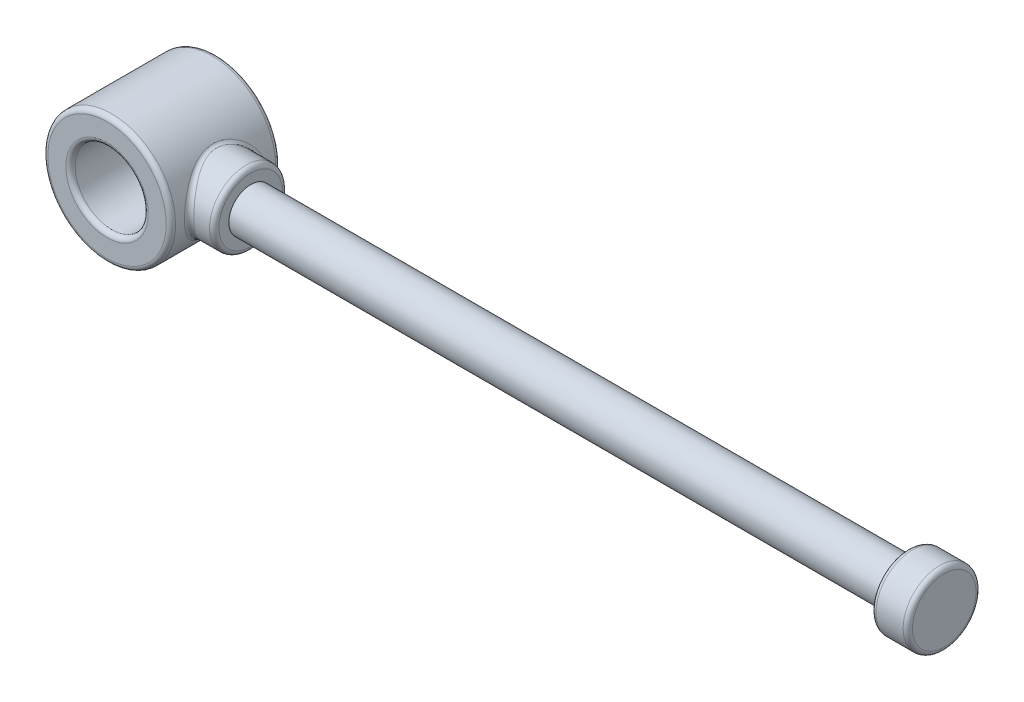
ISO-10303-21;
HEADER;
FILE_DESCRIPTION(('STEP AP214'),'2;1');
FILE_NAME('part.step','',(''),(''),'','','');
FILE_SCHEMA(('AUTOMOTIVE_DESIGN { 1 0 10303 214 1 1 1 1 }'));
ENDSEC;
DATA;
#1=APPLICATION_CONTEXT('core data for automotive mechanical design processes');
#2=APPLICATION_PROTOCOL_DEFINITION('international standard','automotive_design',2000,#1);
#3=PRODUCT_CONTEXT('',#1,'mechanical');
#4=PRODUCT('Part','Part','',(#3));
#5=PRODUCT_RELATED_PRODUCT_CATEGORY('part','',(#4));
#6=PRODUCT_DEFINITION_FORMATION('','',#4);
#7=PRODUCT_DEFINITION_CONTEXT('part definition',#1,'design');
#8=PRODUCT_DEFINITION('design','',#6,#7);
#9=PRODUCT_DEFINITION_SHAPE('','',#8);
#10=(LENGTH_UNIT() NAMED_UNIT(*) SI_UNIT(.MILLI.,.METRE.));
#11=(NAMED_UNIT(*) PLANE_ANGLE_UNIT() SI_UNIT($,.RADIAN.));
#12=(NAMED_UNIT(*) SI_UNIT($,.STERADIAN.) SOLID_ANGLE_UNIT());
#13=UNCERTAINTY_MEASURE_WITH_UNIT(LENGTH_MEASURE(1.E-05),#10,'distance_accuracy_value','');
#14=(GEOMETRIC_REPRESENTATION_CONTEXT(3) GLOBAL_UNCERTAINTY_ASSIGNED_CONTEXT((#13)) GLOBAL_UNIT_ASSIGNED_CONTEXT((#10,
#11,#12)) REPRESENTATION_CONTEXT('',''));
#15=CARTESIAN_POINT('',(0.,0.,0.));
#16=DIRECTION('',(0.,0.,1.));
#17=DIRECTION('',(1.,0.,0.));
#18=AXIS2_PLACEMENT_3D('',#15,#16,#17);
#19=CARTESIAN_POINT('',(-127.,0.,0.));
#20=DIRECTION('',(-1.,0.,0.));
#21=DIRECTION('',(0.,0.,1.));
#22=AXIS2_PLACEMENT_3D('',#19,#20,#21);
#23=CYLINDRICAL_SURFACE('',#22,6.34999999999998);
#24=CARTESIAN_POINT('',(-121.4628,0.,0.));
#25=DIRECTION('',(-1.,0.,0.));
#26=DIRECTION('',(0.,0.,1.));
#27=AXIS2_PLACEMENT_3D('',#24,#25,#26);
#28=CIRCLE('',#27,6.34999999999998);
#29=CARTESIAN_POINT('',(-121.4628,0.,6.34999999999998));
#30=VERTEX_POINT('',#29);
#31=EDGE_CURVE('E109',#30,#30,#28,.T.);
#32=ORIENTED_EDGE('',*,*,#31,.T.);
#33=EDGE_LOOP('',(#32));
#34=FACE_BOUND('',#33,.T.);
#35=CARTESIAN_POINT('',(-124.19583062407,0.175188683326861,6.34758291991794));
#36=CARTESIAN_POINT('',(-125.008147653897,0.161736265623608,6.34795419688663));
#37=CARTESIAN_POINT('',(-125.008519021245,0.184144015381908,7.16007353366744));
#38=CARTESIAN_POINT('',(-124.192857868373,0.0162274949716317,6.35197114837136));
#39=CARTESIAN_POINT('',(-125.00605129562,0.014888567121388,6.35166912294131));
#40=CARTESIAN_POINT('',(-125.005748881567,0.0170570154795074,7.16502345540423));
#41=CARTESIAN_POINT('',(-124.193936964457,-0.142945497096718,6.35038100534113));
#42=CARTESIAN_POINT('',(-125.006807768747,-0.131802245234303,6.35033045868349));
#43=CARTESIAN_POINT('',(-125.006754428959,-0.150252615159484,7.16322977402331));
#44=CARTESIAN_POINT('',(-124.2041669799,-0.460571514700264,6.33527101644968));
#45=CARTESIAN_POINT('',(-125.014027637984,-0.425273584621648,6.33753016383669));
#46=CARTESIAN_POINT('',(-125.016287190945,-0.484115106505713,7.1461857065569));
#47=CARTESIAN_POINT('',(-124.21332039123,-0.619024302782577,6.32174748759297));
#48=CARTESIAN_POINT('',(-125.020476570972,-0.571724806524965,6.32609418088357));
#49=CARTESIAN_POINT('',(-125.024816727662,-0.650667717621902,7.13093116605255));
#50=CARTESIAN_POINT('',(-124.239479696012,-0.933903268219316,6.28295068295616));
#51=CARTESIAN_POINT('',(-125.039069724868,-0.864115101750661,6.29302412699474));
#52=CARTESIAN_POINT('',(-125.049193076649,-0.981642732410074,7.0871683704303));
#53=CARTESIAN_POINT('',(-124.256482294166,-1.09033026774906,6.25768233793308));
#54=CARTESIAN_POINT('',(-125.051171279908,-1.00974450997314,6.2714662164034));
#55=CARTESIAN_POINT('',(-125.06503681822,-1.14606600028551,7.05866567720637));
#56=CARTESIAN_POINT('',(-124.297926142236,-1.40013981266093,6.19573321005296));
#57=CARTESIAN_POINT('',(-125.080993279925,-1.29995842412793,6.21808658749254));
#58=CARTESIAN_POINT('',(-125.103655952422,-1.47171245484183,6.98878706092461));
#59=CARTESIAN_POINT('',(-124.322370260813,-1.55352115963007,6.15904802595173));
#60=CARTESIAN_POINT('',(-125.098655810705,-1.44426912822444,6.18636960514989));
#61=CARTESIAN_POINT('',(-125.126434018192,-1.63293438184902,6.94740617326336));
#62=CARTESIAN_POINT('',(-124.404695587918,-2.00003127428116,6.0345707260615));
#63=CARTESIAN_POINT('',(-125.158680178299,-1.86613461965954,6.07792607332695));
#64=CARTESIAN_POINT('',(-125.203148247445,-2.1022692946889,6.80699577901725));
#65=CARTESIAN_POINT('',(-124.472292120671,-2.28762069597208,5.9313198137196));
#66=CARTESIAN_POINT('',(-125.208554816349,-2.14174897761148,5.9871022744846));
#67=CARTESIAN_POINT('',(-125.266137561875,-2.40455977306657,6.69052874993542));
#68=CARTESIAN_POINT('',(-124.628375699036,-2.84116359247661,5.6870093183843));
#69=CARTESIAN_POINT('',(-125.327321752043,-2.68128065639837,5.76603426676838));
#70=CARTESIAN_POINT('',(-125.411582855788,-2.98639879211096,6.41494651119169));
#71=CARTESIAN_POINT('',(-124.716866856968,-3.10711279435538,5.54594229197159));
#72=CARTESIAN_POINT('',(-125.395615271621,-2.94431020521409,5.63697972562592));
#73=CARTESIAN_POINT('',(-125.494042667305,-3.26594284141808,6.25582290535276));
#74=CARTESIAN_POINT('',(-124.918360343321,-3.63992624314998,5.21363099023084));
#75=CARTESIAN_POINT('',(-125.555092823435,-3.47826543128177,5.32578315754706));
#76=CARTESIAN_POINT('',(-125.681802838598,-3.82599276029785,5.88097575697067));
#77=CARTESIAN_POINT('',(-125.032954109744,-3.90401451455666,5.01869611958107));
#78=CARTESIAN_POINT('',(-125.647512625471,-3.74768602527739,5.14053858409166));
#79=CARTESIAN_POINT('',(-125.788586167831,-4.10358075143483,5.66108922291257));
#80=CARTESIAN_POINT('',(-125.270671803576,-4.39771563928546,4.59230158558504));
#81=CARTESIAN_POINT('',(-125.843452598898,-4.25698332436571,4.72673534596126));
#82=CARTESIAN_POINT('',(-126.01010159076,-4.62251899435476,5.1801161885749));
#83=CARTESIAN_POINT('',(-125.393805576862,-4.6272876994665,4.36079935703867));
#84=CARTESIAN_POINT('',(-125.946727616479,-4.49754235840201,4.49914343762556));
#85=CARTESIAN_POINT('',(-126.12484285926,-4.86382636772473,4.91898167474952));
#86=CARTESIAN_POINT('',(-125.654509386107,-5.07632283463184,3.8325975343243));
#87=CARTESIAN_POINT('',(-126.168263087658,-4.97047934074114,3.97286178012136));
#88=CARTESIAN_POINT('',(-126.367777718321,-5.3358153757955,4.32317001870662));
#89=CARTESIAN_POINT('',(-125.791864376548,-5.29054919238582,3.53133169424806));
#90=CARTESIAN_POINT('',(-126.287295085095,-5.20011375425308,3.66845934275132));
#91=CARTESIAN_POINT('',(-126.495770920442,-5.56099260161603,3.98334215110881));
#92=CARTESIAN_POINT('',(-126.048094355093,-5.66550570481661,2.89166305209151));
#93=CARTESIAN_POINT('',(-126.511141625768,-5.60279061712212,3.01541509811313));
#94=CARTESIAN_POINT('',(-126.734536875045,-5.95511622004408,3.26179592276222));
#95=CARTESIAN_POINT('',(-126.166988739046,-5.82629221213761,2.55329987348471));
#96=CARTESIAN_POINT('',(-126.616758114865,-5.77795014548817,2.66629766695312));
#97=CARTESIAN_POINT('',(-126.845327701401,-6.12412184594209,2.88012225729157));
#98=CARTESIAN_POINT('',(-126.346192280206,-6.05926126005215,1.92223346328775));
#99=CARTESIAN_POINT('',(-126.776325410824,-6.03152202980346,2.01122044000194));
#100=CARTESIAN_POINT('',(-127.012317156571,-6.36899985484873,2.16827934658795));
#101=CARTESIAN_POINT('',(-126.41361076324,-6.14308605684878,1.63548309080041));
#102=CARTESIAN_POINT('',(-126.836888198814,-6.1233894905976,1.71212536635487));
#103=CARTESIAN_POINT('',(-127.075140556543,-6.45710962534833,1.84482492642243));
#104=CARTESIAN_POINT('',(-126.491426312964,-6.23819850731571,1.19579700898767));
#105=CARTESIAN_POINT('',(-126.906797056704,-6.2275291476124,1.25230030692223));
#106=CARTESIAN_POINT('',(-127.147652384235,-6.5570840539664,1.34885902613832));
#107=CARTESIAN_POINT('',(-126.513478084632,-6.26479703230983,1.04766188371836));
#108=CARTESIAN_POINT('',(-126.92662707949,-6.25666154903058,1.09736539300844));
#109=CARTESIAN_POINT('',(-127.168201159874,-6.5850422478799,1.1817626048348));
#110=CARTESIAN_POINT('',(-126.549063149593,-6.30745876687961,0.749108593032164));
#111=CARTESIAN_POINT('',(-126.958615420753,-6.30335699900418,0.785012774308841));
#112=CARTESIAN_POINT('',(-127.20136083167,-6.62988477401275,0.844994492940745));
#113=CARTESIAN_POINT('',(-126.562599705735,-6.32352601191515,0.598691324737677));
#114=CARTESIAN_POINT('',(-126.970815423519,-6.32098196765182,0.627411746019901));
#115=CARTESIAN_POINT('',(-127.213974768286,-6.6467733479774,0.675323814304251));
#116=CARTESIAN_POINT('',(-126.580655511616,-6.34491590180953,0.296059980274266));
#117=CARTESIAN_POINT('',(-126.987071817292,-6.34441920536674,0.310382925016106));
#118=CARTESIAN_POINT('',(-127.23079993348,-6.66925665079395,0.333955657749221));
#119=CARTESIAN_POINT('',(-126.585138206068,-6.35019499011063,0.14384110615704));
#120=CARTESIAN_POINT('',(-126.991116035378,-6.35021372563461,0.15074808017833));
#121=CARTESIAN_POINT('',(-127.234977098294,-6.67480559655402,0.162252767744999));
#122=CARTESIAN_POINT('',(-126.584798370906,-6.34979398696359,-0.160573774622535));
#123=CARTESIAN_POINT('',(-126.990809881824,-6.34977418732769,-0.16828823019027));
#124=CARTESIAN_POINT('',(-127.234660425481,-6.67438409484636,-0.181127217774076));
#125=CARTESIAN_POINT('',(-126.579975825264,-6.34411387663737,-0.312769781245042));
#126=CARTESIAN_POINT('',(-126.986459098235,-6.34353953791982,-0.327896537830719));
#127=CARTESIAN_POINT('',(-127.230166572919,-6.66841362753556,-0.352804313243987));
#128=CARTESIAN_POINT('',(-126.561214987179,-6.32188204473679,-0.615964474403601));
#129=CARTESIAN_POINT('',(-126.969568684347,-6.31918039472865,-0.645505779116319));
#130=CARTESIAN_POINT('',(-127.212684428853,-6.64504534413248,-0.694807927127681));
#131=CARTESIAN_POINT('',(-126.547274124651,-6.30532725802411,-0.766962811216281));
#132=CARTESIAN_POINT('',(-126.957005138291,-6.30102128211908,-0.803707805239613));
#133=CARTESIAN_POINT('',(-127.199693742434,-6.62764430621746,-0.865134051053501));
#134=CARTESIAN_POINT('',(-126.510834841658,-6.26161352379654,-1.06661277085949));
#135=CARTESIAN_POINT('',(-126.924251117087,-6.2531766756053,-1.11718581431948));
#136=CARTESIAN_POINT('',(-127.165738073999,-6.58169600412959,-1.203139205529));
#137=CARTESIAN_POINT('',(-126.488333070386,-6.23445042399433,-1.21526345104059));
#138=CARTESIAN_POINT('',(-126.904017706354,-6.22342731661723,-1.27264664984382));
#139=CARTESIAN_POINT('',(-127.14476996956,-6.55314437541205,-1.37081717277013));
#140=CARTESIAN_POINT('',(-126.411760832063,-6.14075389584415,-1.64175701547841));
#141=CARTESIAN_POINT('',(-126.83524949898,-6.1208653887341,-1.71854664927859));
#142=CARTESIAN_POINT('',(-127.07341671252,-6.45465824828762,-1.85190191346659));
#143=CARTESIAN_POINT('',(-126.347512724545,-6.06079754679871,-1.91534593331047));
#144=CARTESIAN_POINT('',(-126.777569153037,-6.03327868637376,-2.0038332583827));
#145=CARTESIAN_POINT('',(-127.013547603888,-6.37061467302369,-2.1605102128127));
#146=CARTESIAN_POINT('',(-126.198254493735,-5.86710447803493,-2.44529088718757));
#147=CARTESIAN_POINT('',(-126.644833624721,-5.82276907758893,-2.5532019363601));
#148=CARTESIAN_POINT('',(-126.874462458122,-6.1670203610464,-2.7582881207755));
#149=CARTESIAN_POINT('',(-126.11323655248,-5.75335503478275,-2.70164038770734));
#150=CARTESIAN_POINT('',(-126.569334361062,-5.69905029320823,-2.81802583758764));
#151=CARTESIAN_POINT('',(-126.795239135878,-6.04745625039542,-3.04745035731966));
#152=CARTESIAN_POINT('',(-125.916117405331,-5.47519309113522,-3.23228873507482));
#153=CARTESIAN_POINT('',(-126.395980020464,-5.39886414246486,-3.36292326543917));
#154=CARTESIAN_POINT('',(-126.611555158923,-5.75507516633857,-3.64602169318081));
#155=CARTESIAN_POINT('',(-125.801861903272,-5.30568026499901,-3.50328816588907));
#156=CARTESIAN_POINT('',(-126.296154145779,-5.21635665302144,-3.63889251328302));
#157=CARTESIAN_POINT('',(-126.505087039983,-5.57689714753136,-3.95170905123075));
#158=CARTESIAN_POINT('',(-125.567010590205,-4.92934253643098,-4.01564185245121));
#159=CARTESIAN_POINT('',(-126.0939030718,-4.81612380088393,-4.15545352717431));
#160=CARTESIAN_POINT('',(-126.286242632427,-5.18132170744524,-4.5296440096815));
#161=CARTESIAN_POINT('',(-125.446409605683,-4.72248684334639,-4.25697136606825));
#162=CARTESIAN_POINT('',(-125.99116963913,-4.59712834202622,-4.3959102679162));
#163=CARTESIAN_POINT('',(-126.173861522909,-4.96389192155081,-4.80186370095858));
#164=CARTESIAN_POINT('',(-125.189100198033,-4.2372444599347,-4.74390856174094));
#165=CARTESIAN_POINT('',(-125.775191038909,-4.08985723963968,-4.87616472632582));
#166=CARTESIAN_POINT('',(-125.934089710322,-4.45384481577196,-5.35112885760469));
#167=CARTESIAN_POINT('',(-125.052991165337,-3.95269069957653,-4.98373560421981));
#168=CARTESIAN_POINT('',(-125.663530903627,-3.79584366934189,-5.10733893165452));
#169=CARTESIAN_POINT('',(-125.80725754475,-4.15474517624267,-5.62165376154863));
#170=CARTESIAN_POINT('',(-124.863043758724,-3.49464880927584,-5.30517318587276));
#171=CARTESIAN_POINT('',(-125.51180957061,-3.33464303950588,-5.41053019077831));
#172=CARTESIAN_POINT('',(-125.63025650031,-3.67328900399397,-5.98423535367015));
#173=CARTESIAN_POINT('',(-124.802052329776,-3.33662124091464,-5.40600338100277));
#174=CARTESIAN_POINT('',(-125.463450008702,-3.17576572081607,-5.5050670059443));
#175=CARTESIAN_POINT('',(-125.573422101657,-3.50718334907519,-6.09797181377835));
#176=CARTESIAN_POINT('',(-124.686433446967,-3.01091145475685,-5.59394337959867));
#177=CARTESIAN_POINT('',(-125.37274309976,-2.85125683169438,-5.67974631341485));
#178=CARTESIAN_POINT('',(-125.465683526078,-3.1648238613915,-6.30996813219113));
#179=CARTESIAN_POINT('',(-124.631802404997,-2.84323476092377,-5.68106092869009));
#180=CARTESIAN_POINT('',(-125.330518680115,-2.68569802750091,-5.75961550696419));
#181=CARTESIAN_POINT('',(-125.414776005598,-2.98857583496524,-6.40823672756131));
#182=CARTESIAN_POINT('',(-124.531966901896,-2.50431871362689,-5.83821434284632));
#183=CARTESIAN_POINT('',(-125.254171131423,-2.35414995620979,-5.90243705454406));
#184=CARTESIAN_POINT('',(-125.321745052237,-2.63233500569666,-6.58550577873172));
#185=CARTESIAN_POINT('',(-124.486531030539,-2.33333226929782,-5.9086799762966));
#186=CARTESIAN_POINT('',(-125.219968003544,-2.18843923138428,-5.96557003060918));
#187=CARTESIAN_POINT('',(-125.279405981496,-2.45260804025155,-6.6649910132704));
#188=CARTESIAN_POINT('',(-124.404445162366,-1.98446589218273,-6.03479602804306));
#189=CARTESIAN_POINT('',(-125.158721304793,-1.85307067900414,-6.07774195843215));
#190=CARTESIAN_POINT('',(-125.20291489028,-2.08590823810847,-6.80724991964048));
#191=CARTESIAN_POINT('',(-124.367790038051,-1.80659005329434,-6.09045509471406));
#192=CARTESIAN_POINT('',(-125.131809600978,-1.68370346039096,-6.12652958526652));
#193=CARTESIAN_POINT('',(-125.168758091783,-1.89893970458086,-6.87003334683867));
#194=CARTESIAN_POINT('',(-124.304455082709,-1.44585990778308,-6.18600895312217));
#195=CARTESIAN_POINT('',(-125.085616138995,-1.34251415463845,-6.20984128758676));
#196=CARTESIAN_POINT('',(-125.109739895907,-1.51976967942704,-6.97781809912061));
#197=CARTESIAN_POINT('',(-124.277746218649,-1.26302178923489,-6.22594964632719));
#198=CARTESIAN_POINT('',(-125.066431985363,-1.17109036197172,-6.24418657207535));
#199=CARTESIAN_POINT('',(-125.084851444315,-1.32758520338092,-7.02287120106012));
#200=CARTESIAN_POINT('',(-124.235034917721,-0.893677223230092,-6.28958667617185));
#201=CARTESIAN_POINT('',(-125.035847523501,-0.826316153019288,-6.29878527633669));
#202=CARTESIAN_POINT('',(-125.045051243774,-0.939360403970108,-7.09465377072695));
#203=CARTESIAN_POINT('',(-124.21902358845,-0.707173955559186,-6.31329650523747));
#204=CARTESIAN_POINT('',(-125.024529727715,-0.65344577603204,-6.31889041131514));
#205=CARTESIAN_POINT('',(-125.030131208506,-0.743323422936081,-7.12139845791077));
#206=CARTESIAN_POINT('',(-124.203791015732,-0.432928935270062,-6.33582573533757));
#207=CARTESIAN_POINT('',(-125.013763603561,-0.399802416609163,-6.33799784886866));
#208=CARTESIAN_POINT('',(-125.015936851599,-0.455059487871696,-7.14681142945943));
#209=CARTESIAN_POINT('',(-124.2001703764,-0.34585921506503,-6.34117452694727));
#210=CARTESIAN_POINT('',(-125.01120871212,-0.319347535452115,-6.34252818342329));
#211=CARTESIAN_POINT('',(-125.012562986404,-0.363538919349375,-7.15284486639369));
#212=CARTESIAN_POINT('',(-124.19535711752,-0.171515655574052,-6.34828264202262));
#213=CARTESIAN_POINT('',(-125.007812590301,-0.158302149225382,-6.34854847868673));
#214=CARTESIAN_POINT('',(-125.008077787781,-0.180283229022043,-7.16086282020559));
#215=CARTESIAN_POINT('',(-124.194164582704,-0.0842418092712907,-6.35004184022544));
#216=CARTESIAN_POINT('',(-125.006973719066,-0.0777660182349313,-6.35003425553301));
#217=CARTESIAN_POINT('',(-125.006966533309,-0.0885480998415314,-7.16284719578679));
#218=CARTESIAN_POINT('',(-124.194247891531,0.165532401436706,-6.3499200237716));
#219=CARTESIAN_POINT('',(-125.007030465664,0.15280582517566,-6.34993446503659));
#220=CARTESIAN_POINT('',(-125.007044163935,0.173994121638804,-7.16270978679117));
#221=CARTESIAN_POINT('',(-124.198535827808,0.328058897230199,-6.34359657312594));
#222=CARTESIAN_POINT('',(-125.010041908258,0.302663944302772,-6.34460204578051));
#223=CARTESIAN_POINT('',(-125.011039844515,0.344828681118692,-7.1555769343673));
#224=CARTESIAN_POINT('',(-124.21547861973,0.651874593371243,-6.31854109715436));
#225=CARTESIAN_POINT('',(-125.022025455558,0.602293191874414,-6.32333584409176));
#226=CARTESIAN_POINT('',(-125.026827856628,0.685197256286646,-7.12731435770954));
#227=CARTESIAN_POINT('',(-124.22813834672,0.813163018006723,-6.29980184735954));
#228=CARTESIAN_POINT('',(-125.030973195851,0.7517187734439,-6.30744534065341));
#229=CARTESIAN_POINT('',(-125.038624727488,0.854730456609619,-7.10617648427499));
#230=CARTESIAN_POINT('',(-124.261544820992,1.13350425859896,-6.25011793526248));
#231=CARTESIAN_POINT('',(-125.054826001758,1.05015199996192,-6.26492576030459));
#232=CARTESIAN_POINT('',(-125.069754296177,1.19144696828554,-7.05013303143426));
#233=CARTESIAN_POINT('',(-124.282306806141,1.29255227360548,-6.2191502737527));
#234=CARTESIAN_POINT('',(-125.069689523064,1.19884093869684,-6.23837105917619));
#235=CARTESIAN_POINT('',(-125.089101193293,1.35862523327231,-7.0152015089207));
#236=CARTESIAN_POINT('',(-124.331399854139,1.60697722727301,-6.14542528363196));
#237=CARTESIAN_POINT('',(-125.105259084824,1.49482775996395,-6.17446135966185));
#238=CARTESIAN_POINT('',(-125.134848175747,1.6891230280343,-6.93203971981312));
#239=CARTESIAN_POINT('',(-124.359734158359,1.76235256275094,-6.10266290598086));
#240=CARTESIAN_POINT('',(-125.125895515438,1.64185214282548,-6.13723328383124));
#241=CARTESIAN_POINT('',(-125.16125128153,1.85244087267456,-6.88380375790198));
#242=CARTESIAN_POINT('',(-124.454807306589,2.21973103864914,-5.9579327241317));
#243=CARTESIAN_POINT('',(-125.195789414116,2.07645322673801,-6.01024016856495));
#244=CARTESIAN_POINT('',(-125.24984447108,2.33319971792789,-6.72054811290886));
#245=CARTESIAN_POINT('',(-124.531833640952,2.51495350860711,-5.839209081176));
#246=CARTESIAN_POINT('',(-125.253239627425,2.36164176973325,-5.90482789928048));
#247=CARTESIAN_POINT('',(-125.321620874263,2.64351343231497,-6.58662784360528));
#248=CARTESIAN_POINT('',(-124.706757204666,3.08019987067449,-5.56185483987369));
#249=CARTESIAN_POINT('',(-125.38790562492,2.91717720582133,-5.65127815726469));
#250=CARTESIAN_POINT('',(-125.484622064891,3.23765417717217,-6.27377225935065));
#251=CARTESIAN_POINT('',(-124.804649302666,3.35022993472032,-5.40323405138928));
#252=CARTESIAN_POINT('',(-125.464453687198,3.18678105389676,-5.50451288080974));
#253=CARTESIAN_POINT('',(-125.575842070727,3.52148769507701,-6.09484800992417));
#254=CARTESIAN_POINT('',(-125.021917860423,3.88106992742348,-5.03701802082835));
#255=CARTESIAN_POINT('',(-125.638625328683,3.72362627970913,-5.15770059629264));
#256=CARTESIAN_POINT('',(-125.778302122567,4.07946327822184,-5.68175632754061));
#257=CARTESIAN_POINT('',(-125.142366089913,4.13958561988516,-4.82660031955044));
#258=CARTESIAN_POINT('',(-125.737034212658,3.98974918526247,-4.95549503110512));
#259=CARTESIAN_POINT('',(-125.890540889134,4.3511938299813,-5.44440516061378));
#260=CARTESIAN_POINT('',(-125.388943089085,4.61988395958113,-4.36914288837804));
#261=CARTESIAN_POINT('',(-125.942509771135,4.48902658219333,-4.50729131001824));
#262=CARTESIAN_POINT('',(-126.120311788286,4.85604416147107,-4.928393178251));
#263=CARTESIAN_POINT('',(-125.515079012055,4.8416186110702,-4.12205609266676));
#264=CARTESIAN_POINT('',(-126.049455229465,4.72310489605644,-4.26211946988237));
#265=CARTESIAN_POINT('',(-126.237850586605,5.0891134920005,-4.64967927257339));
#266=CARTESIAN_POINT('',(-125.777181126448,5.26969181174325,-3.56254323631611));
#267=CARTESIAN_POINT('',(-126.274177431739,5.17676499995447,-3.70028412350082));
#268=CARTESIAN_POINT('',(-126.482088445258,5.53906902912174,-4.01854877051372));
#269=CARTESIAN_POINT('',(-125.912452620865,5.47079684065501,-3.24581959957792));
#270=CARTESIAN_POINT('',(-126.392411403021,5.3935713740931,-3.37796029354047));
#271=CARTESIAN_POINT('',(-126.608140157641,5.7504541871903,-3.66128450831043));
#272=CARTESIAN_POINT('',(-126.158364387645,5.81616699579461,-2.57607430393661));
#273=CARTESIAN_POINT('',(-126.608587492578,5.7660445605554,-2.69048327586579));
#274=CARTESIAN_POINT('',(-126.83729116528,6.11347904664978,-2.90581181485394));
#275=CARTESIAN_POINT('',(-126.269044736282,5.96052490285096,-2.2231130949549));
#276=CARTESIAN_POINT('',(-126.707503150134,5.92393629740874,-2.32447962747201));
#277=CARTESIAN_POINT('',(-126.940427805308,6.26521627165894,-2.50767157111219));
#278=CARTESIAN_POINT('',(-126.425105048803,6.15771351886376,-1.57781531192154));
#279=CARTESIAN_POINT('',(-126.847006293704,6.13911958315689,-1.65239878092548));
#280=CARTESIAN_POINT('',(-127.085851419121,6.47248481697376,-1.77977567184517));
#281=CARTESIAN_POINT('',(-126.47980805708,6.22424376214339,-1.29149944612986));
#282=CARTESIAN_POINT('',(-126.896297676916,6.21217135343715,-1.3529449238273));
#283=CARTESIAN_POINT('',(-127.136826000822,6.54241596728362,-1.45681137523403));
#284=CARTESIAN_POINT('',(-126.537713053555,6.29390307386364,-0.855023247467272));
#285=CARTESIAN_POINT('',(-126.948406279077,6.28851342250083,-0.895882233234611));
#286=CARTESIAN_POINT('',(-127.190784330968,6.61563613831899,-0.964466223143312));
#287=CARTESIAN_POINT('',(-126.5529892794,6.31209966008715,-0.708388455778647));
#288=CARTESIAN_POINT('',(-126.962164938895,6.30846340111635,-0.742298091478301));
#289=CARTESIAN_POINT('',(-127.205019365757,6.63476290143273,-0.799062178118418));
#290=CARTESIAN_POINT('',(-126.574998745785,6.3382356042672,-0.413671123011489));
#291=CARTESIAN_POINT('',(-126.981973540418,6.33709280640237,-0.433630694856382));
#292=CARTESIAN_POINT('',(-127.225528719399,6.66223486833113,-0.466621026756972));
#293=CARTESIAN_POINT('',(-126.581731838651,6.34617478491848,-0.26558855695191));
#294=CARTESIAN_POINT('',(-126.988047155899,6.34580664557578,-0.278363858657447));
#295=CARTESIAN_POINT('',(-127.231802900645,6.67057988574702,-0.299583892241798));
#296=CARTESIAN_POINT('',(-126.586380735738,6.35166145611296,0.0311639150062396));
#297=CARTESIAN_POINT('',(-126.992235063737,6.35182078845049,0.0326313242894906));
#298=CARTESIAN_POINT('',(-127.236134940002,6.67634702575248,0.0351528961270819));
#299=CARTESIAN_POINT('',(-126.584279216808,6.34918853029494,0.179834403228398));
#300=CARTESIAN_POINT('',(-126.990338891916,6.34910609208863,0.188551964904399));
#301=CARTESIAN_POINT('',(-127.234176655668,6.67374768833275,0.202853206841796));
#302=CARTESIAN_POINT('',(-126.571307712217,6.33384918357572,0.476331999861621));
#303=CARTESIAN_POINT('',(-126.978657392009,6.33229617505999,0.499219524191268));
#304=CARTESIAN_POINT('',(-127.222089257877,6.65762422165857,0.537302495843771));
#305=CARTESIAN_POINT('',(-126.560437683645,6.3209827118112,0.624159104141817));
#306=CARTESIAN_POINT('',(-126.96885769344,6.31818024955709,0.654156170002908));
#307=CARTESIAN_POINT('',(-127.211960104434,6.64410003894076,0.704051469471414));
#308=CARTESIAN_POINT('',(-126.530332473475,6.28504287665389,0.9179559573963));
#309=CARTESIAN_POINT('',(-126.941779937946,6.27882636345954,0.961669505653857));
#310=CARTESIAN_POINT('',(-127.183906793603,6.60632302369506,1.03545431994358));
#311=CARTESIAN_POINT('',(-126.511093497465,6.26196488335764,1.06392483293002));
#312=CARTESIAN_POINT('',(-126.924466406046,6.25353619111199,1.11442377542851));
#313=CARTESIAN_POINT('',(-127.16597910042,6.58206532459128,1.20010721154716));
#314=CARTESIAN_POINT('',(-126.464948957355,6.20593158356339,1.35300663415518));
#315=CARTESIAN_POINT('',(-126.883054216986,6.19227124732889,1.41643225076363));
#316=CARTESIAN_POINT('',(-127.122979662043,6.5231677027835,1.52619148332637));
#317=CARTESIAN_POINT('',(-126.438040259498,6.17297223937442,1.49611836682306));
#318=CARTESIAN_POINT('',(-126.858906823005,6.15622196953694,1.56584482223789));
#319=CARTESIAN_POINT('',(-127.097904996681,6.48852353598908,1.68762151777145));
#320=CARTESIAN_POINT('',(-126.347909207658,6.06084979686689,1.91616891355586));
#321=CARTESIAN_POINT('',(-126.778108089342,6.03361944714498,2.00436790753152));
#322=CARTESIAN_POINT('',(-127.013917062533,6.37066959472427,2.1614385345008));
#323=CARTESIAN_POINT('',(-126.274820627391,5.96792475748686,2.18790813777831));
#324=CARTESIAN_POINT('',(-126.712694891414,5.93202885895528,2.28696740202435));
#325=CARTESIAN_POINT('',(-126.945810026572,6.27299439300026,2.46796037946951));
#326=CARTESIAN_POINT('',(-126.110114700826,5.74855903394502,2.7125007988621));
#327=CARTESIAN_POINT('',(-126.56675980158,5.69420187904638,2.82906130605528));
#328=CARTESIAN_POINT('',(-126.792330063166,6.04241508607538,3.05970090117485));
#329=CARTESIAN_POINT('',(-126.018490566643,5.6221060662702,2.96534727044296));
#330=CARTESIAN_POINT('',(-126.4857867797,5.55709780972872,3.08918432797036));
#331=CARTESIAN_POINT('',(-126.706950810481,5.90949806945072,3.34491172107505));
#332=CARTESIAN_POINT('',(-125.807603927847,5.31367268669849,3.49229451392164));
#333=CARTESIAN_POINT('',(-126.30128899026,5.22538353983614,3.62787145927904));
#334=CARTESIAN_POINT('',(-126.510437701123,5.58529812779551,3.93930821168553));
#335=CARTESIAN_POINT('',(-125.686312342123,5.12584345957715,3.76234655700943));
#336=CARTESIAN_POINT('',(-126.196080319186,5.02409204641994,3.90113945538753));
#337=CARTESIAN_POINT('',(-126.397413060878,5.38786740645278,4.24392691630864));
#338=CARTESIAN_POINT('',(-125.440640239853,4.71151264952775,4.26986517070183));
#339=CARTESIAN_POINT('',(-125.986282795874,4.58599150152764,4.40910258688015));
#340=CARTESIAN_POINT('',(-126.168485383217,4.95235674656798,4.81640791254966));
#341=CARTESIAN_POINT('',(-125.316256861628,4.48497400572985,4.50730011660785));
#342=CARTESIAN_POINT('',(-125.881487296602,4.34787312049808,4.64341404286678));
#343=CARTESIAN_POINT('',(-126.052579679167,4.71423785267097,5.08423453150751));
#344=CARTESIAN_POINT('',(-125.057878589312,3.96175395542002,4.97662298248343));
#345=CARTESIAN_POINT('',(-125.667265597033,3.80563481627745,5.10133912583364));
#346=CARTESIAN_POINT('',(-125.811811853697,4.16427172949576,5.6136307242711));
#347=CARTESIAN_POINT('',(-124.924966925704,3.65969516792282,5.20310652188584));
#348=CARTESIAN_POINT('',(-125.559947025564,3.49684969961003,5.31665295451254));
#349=CARTESIAN_POINT('',(-125.687959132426,3.84677223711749,5.86910415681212));
#350=CARTESIAN_POINT('',(-124.74355319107,3.17639902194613,5.50172509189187));
#351=CARTESIAN_POINT('',(-125.417303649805,3.01559347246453,5.59446775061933));
#352=CARTESIAN_POINT('',(-125.518910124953,3.33877085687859,6.20594590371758));
#353=CARTESIAN_POINT('',(-124.6860528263,3.01018559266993,5.59444533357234));
#354=CARTESIAN_POINT('',(-125.372490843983,2.85048972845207,5.68010171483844));
#355=CARTESIAN_POINT('',(-125.465328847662,3.16406089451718,6.31053433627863));
#356=CARTESIAN_POINT('',(-124.578628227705,2.66858645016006,5.76520026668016));
#357=CARTESIAN_POINT('',(-125.289642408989,2.51426352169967,5.83644855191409));
#358=CARTESIAN_POINT('',(-125.365226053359,2.80499981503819,6.50314590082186));
#359=CARTESIAN_POINT('',(-124.528699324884,2.49320648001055,5.84324401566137));
#360=CARTESIAN_POINT('',(-125.251748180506,2.34329830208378,5.90686809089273));
#361=CARTESIAN_POINT('',(-125.318700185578,2.62065473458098,6.5911792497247));
#362=CARTESIAN_POINT('',(-124.440781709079,2.14573366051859,5.97920827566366));
#363=CARTESIAN_POINT('',(-125.185690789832,2.00764372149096,6.02853366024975));
#364=CARTESIAN_POINT('',(-125.23677482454,2.25541972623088,6.74454693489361));
#365=CARTESIAN_POINT('',(-124.402240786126,1.97412366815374,6.03808341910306));
#366=CARTESIAN_POINT('',(-125.157176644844,1.84336552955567,6.08048971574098));
#367=CARTESIAN_POINT('',(-125.200860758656,2.075037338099,6.81095809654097));
#368=CARTESIAN_POINT('',(-124.334263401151,1.62525992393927,6.14117919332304));
#369=CARTESIAN_POINT('',(-125.107250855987,1.51175326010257,6.17092765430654));
#370=CARTESIAN_POINT('',(-125.13751655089,1.70834030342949,6.92725013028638));
#371=CARTESIAN_POINT('',(-124.304821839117,1.4480093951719,6.18540803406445));
#372=CARTESIAN_POINT('',(-125.085953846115,1.34475736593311,6.20919675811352));
#373=CARTESIAN_POINT('',(-125.1100816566,1.52202904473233,6.97714026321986));
#374=CARTESIAN_POINT('',(-124.255931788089,1.08943669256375,6.25852090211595));
#375=CARTESIAN_POINT('',(-125.050745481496,1.0086666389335,6.27223802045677));
#376=CARTESIAN_POINT('',(-125.064523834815,1.1451267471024,7.05961157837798));
#377=CARTESIAN_POINT('',(-124.236475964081,0.908117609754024,6.28741619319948));
#378=CARTESIAN_POINT('',(-125.036923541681,0.839996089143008,6.2968484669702));
#379=CARTESIAN_POINT('',(-125.046394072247,0.954538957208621,7.09220546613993));
#380=CARTESIAN_POINT('',(-124.2081471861,0.543023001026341,6.32940555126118));
#381=CARTESIAN_POINT('',(-125.016808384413,0.501228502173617,6.33260914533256));
#382=CARTESIAN_POINT('',(-125.019996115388,0.570781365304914,7.13956946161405));
#383=CARTESIAN_POINT('',(-124.199272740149,0.359247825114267,6.34250184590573));
#384=CARTESIAN_POINT('',(-125.010572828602,0.331617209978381,6.34365658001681));
#385=CARTESIAN_POINT('',(-125.011726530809,0.377611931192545,7.1543420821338));
#386=CARTESIAN_POINT('',(-124.19583062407,0.175188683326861,6.34758291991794));
#387=CARTESIAN_POINT('',(-125.008147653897,0.161736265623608,6.34795419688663));
#388=CARTESIAN_POINT('',(-125.008519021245,0.184144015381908,7.16007353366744));
#389=(BOUNDED_SURFACE() B_SPLINE_SURFACE(3,2,((#35,#36,#37),(#38,#39,#40),(#41,#42,#43),(#44,
#45,#46),(#47,#48,#49),(#50,#51,#52),(#53,#54,#55),(#56,#57,#58),(#59,#60,#61),(#62,#63,#64),
(#65,#66,#67),(#68,#69,#70),(#71,#72,#73),(#74,#75,#76),(#77,#78,#79),(#80,#81,#82),(#83,#84,
#85),(#86,#87,#88),(#89,#90,#91),(#92,#93,#94),(#95,#96,#97),(#98,#99,#100),(#101,#102,#103),
(#104,#105,#106),(#107,#108,#109),(#110,#111,#112),(#113,#114,#115),(#116,#117,#118),(#119,#120,
#121),(#122,#123,#124),(#125,#126,#127),(#128,#129,#130),(#131,#132,#133),(#134,#135,#136),
(#137,#138,#139),(#140,#141,#142),(#143,#144,#145),(#146,#147,#148),(#149,#150,#151),(#152,#153,
#154),(#155,#156,#157),(#158,#159,#160),(#161,#162,#163),(#164,#165,#166),(#167,#168,#169),
(#170,#171,#172),(#173,#174,#175),(#176,#177,#178),(#179,#180,#181),(#182,#183,#184),(#185,#186,
#187),(#188,#189,#190),(#191,#192,#193),(#194,#195,#196),(#197,#198,#199),(#200,#201,#202),
(#203,#204,#205),(#206,#207,#208),(#209,#210,#211),(#212,#213,#214),(#215,#216,#217),(#218,#219,
#220),(#221,#222,#223),(#224,#225,#226),(#227,#228,#229),(#230,#231,#232),(#233,#234,#235),
(#236,#237,#238),(#239,#240,#241),(#242,#243,#244),(#245,#246,#247),(#248,#249,#250),(#251,#252,
#253),(#254,#255,#256),(#257,#258,#259),(#260,#261,#262),(#263,#264,#265),(#266,#267,#268),
(#269,#270,#271),(#272,#273,#274),(#275,#276,#277),(#278,#279,#280),(#281,#282,#283),(#284,#285,
#286),(#287,#288,#289),(#290,#291,#292),(#293,#294,#295),(#296,#297,#298),(#299,#300,#301),
(#302,#303,#304),(#305,#306,#307),(#308,#309,#310),(#311,#312,#313),(#314,#315,#316),(#317,#318,
#319),(#320,#321,#322),(#323,#324,#325),(#326,#327,#328),(#329,#330,#331),(#332,#333,#334),
(#335,#336,#337),(#338,#339,#340),(#341,#342,#343),(#344,#345,#346),(#347,#348,#349),(#350,#351,
#352),(#353,#354,#355),(#356,#357,#358),(#359,#360,#361),(#362,#363,#364),(#365,#366,#367),
(#368,#369,#370),(#371,#372,#373),(#374,#375,#376),(#377,#378,#379),(#380,#381,#382),(#383,#384,
#385),(#386,#387,#388)),.UNSPECIFIED.,.T.,.F.,.F.) B_SPLINE_SURFACE_WITH_KNOTS((4,2,2,2,2,2,2,2,
2,2,2,2,2,2,2,2,2,2,2,2,2,2,2,2,2,2,2,2,2,2,2,2,2,2,2,2,2,2,2,2,2,2,2,2,2,2,2,2,2,2,2,2,2,2,2,2,
2,2,4),(3,3),(0.,0.538005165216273,1.07617643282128,1.61412196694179,2.15227513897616,
3.20122188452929,4.2503752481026,5.40853702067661,6.56805699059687,7.87902383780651,
9.18860384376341,10.2149405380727,10.7279725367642,11.2408078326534,11.7557096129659,
12.2706122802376,12.78566014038,13.3009098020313,14.2803301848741,15.2601198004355,
16.3905402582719,17.5218970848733,18.8386673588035,19.4981550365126,20.157268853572,
20.7968463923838,21.436049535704,22.0733719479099,22.7101639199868,23.0054682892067,
23.3007829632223,23.8505442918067,24.4006257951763,24.951746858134,25.5031042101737,
26.5991346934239,27.694895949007,28.874669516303,30.0559706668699,31.3823213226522,
32.7064943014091,33.7099646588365,34.2115372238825,34.7131184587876,35.2156836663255,
35.7182513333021,36.2210470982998,36.7240485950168,37.7162107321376,38.7087368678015,
39.8753207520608,41.0430278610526,42.3737931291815,43.039764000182,43.7053225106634,
44.3291686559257,44.9526645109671,45.5757017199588,46.198651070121),(0.,1.),
.UNSPECIFIED.) GEOMETRIC_REPRESENTATION_ITEM() RATIONAL_B_SPLINE_SURFACE(((1.,0.707268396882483,
1.),(1.,0.706974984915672,1.),(1.,0.707081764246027,1.),(1.,0.708090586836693,1.),(1.,
0.70899287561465,1.),(1.,0.71155678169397,1.),(1.,0.713218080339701,1.),(1.,0.717234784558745,
1.),(1.,0.719590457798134,1.),(1.,0.727442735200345,1.),(1.,0.733798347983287,1.),(1.,
0.74806323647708,1.),(1.,0.755972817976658,1.),(1.,0.773420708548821,1.),(1.,0.783042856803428,
1.),(1.,0.802296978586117,1.),(1.,0.811928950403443,1.),(1.,0.83163244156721,1.),(1.,
0.841597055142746,1.),(1.,0.859583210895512,1.),(1.,0.867606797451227,1.),(1.,0.879430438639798,
1.),(1.,0.883768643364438,1.),(1.,0.888725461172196,1.),(1.,0.890119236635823,1.),(1.,
0.892360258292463,1.),(1.,0.893207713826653,1.),(1.,0.894336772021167,1.),(1.,0.894616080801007,
1.),(1.,0.894594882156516,1.),(1.,0.894294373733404,1.),(1.,0.893121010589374,1.),(1.,
0.892247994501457,1.),(1.,0.889952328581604,1.),(1.,0.888529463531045,1.),(1.,0.883648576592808,
1.),(1.,0.879511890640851,1.),(1.,0.869674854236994,1.),(1.,0.863973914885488,1.),(1.,
0.850387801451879,1.),(1.,0.842301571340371,1.),(1.,0.825095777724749,1.),(1.,0.81597536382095,
1.),(1.,0.795821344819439,1.),(1.,0.784719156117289,1.),(1.,0.768644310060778,1.),(1.,
0.763378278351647,1.),(1.,0.75322521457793,1.),(1.,0.748337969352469,1.),(1.,0.739272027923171,
1.),(1.,0.735076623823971,1.),(1.,0.727405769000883,1.),(1.,0.723929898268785,1.),(1.,
0.717870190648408,1.),(1.,0.715283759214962,1.),(1.,0.711125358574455,1.),(1.,0.709552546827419,
1.),(1.,0.708053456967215,1.),(1.,0.707696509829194,1.),(1.,0.707221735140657,1.),(1.,
0.707103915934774,1.),(1.,0.70711225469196,1.),(1.,0.707536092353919,1.),(1.,0.709203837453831,
1.),(1.,0.710448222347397,1.),(1.,0.713709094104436,1.),(1.,0.715727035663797,1.),(1.,
0.720454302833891,1.),(1.,0.723163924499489,1.),(1.,0.732151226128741,1.),(1.,0.739309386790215,
1.),(1.,0.755067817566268,1.),(1.,0.763667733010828,1.),(1.,0.782121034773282,1.),(1.,
0.792019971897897,1.),(1.,0.811559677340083,1.),(1.,0.821200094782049,1.),(1.,0.840565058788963,
1.),(1.,0.850154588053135,1.),(1.,0.867062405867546,1.),(1.,0.87438439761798,1.),(1.,
0.884518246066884,1.),(1.,0.887992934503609,1.),(1.,0.891647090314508,1.),(1.,0.892605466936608,
1.),(1.,0.893983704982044,1.),(1.,0.894403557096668,1.),(1.,0.894693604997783,1.),(1.,
0.894562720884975,1.),(1.,0.893752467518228,1.),(1.,0.893073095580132,1.),(1.,0.891181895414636,
1.),(1.,0.889969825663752,1.),(1.,0.887041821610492,1.),(1.,0.885325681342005,1.),(1.,
0.879525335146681,1.),(1.,0.874761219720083,1.),(1.,0.863750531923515,1.),(1.,0.857503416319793,
1.),(1.,0.842703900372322,1.),(1.,0.833939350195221,1.),(1.,0.815534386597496,1.),(1.,
0.805893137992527,1.),(1.,0.785138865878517,1.),(1.,0.774008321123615,1.),(1.,0.758274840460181,
1.),(1.,0.753188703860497,1.),(1.,0.743535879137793,1.),(1.,0.738968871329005,1.),(1.,
0.730819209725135,1.),(1.,0.727192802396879,1.),(1.,0.720734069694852,1.),(1.,0.717901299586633,
1.),(1.,0.713166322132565,1.),(1.,0.71126343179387,1.),(1.,0.708484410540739,1.),(1.,
0.707608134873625,1.),(1.,0.707268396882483,1.))) REPRESENTATION_ITEM('') SURFACE());
#390=CARTESIAN_POINT('',(-124.19583062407,0.175188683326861,6.34758291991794));
#391=CARTESIAN_POINT('',(-124.192857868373,0.0162274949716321,6.35197114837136));
#392=CARTESIAN_POINT('',(-124.193936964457,-0.142945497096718,6.35038100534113));
#393=CARTESIAN_POINT('',(-124.2041669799,-0.460571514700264,6.33527101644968));
#394=CARTESIAN_POINT('',(-124.21332039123,-0.619024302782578,6.32174748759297));
#395=CARTESIAN_POINT('',(-124.239479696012,-0.933903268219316,6.28295068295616));
#396=CARTESIAN_POINT('',(-124.256482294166,-1.09033026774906,6.25768233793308));
#397=CARTESIAN_POINT('',(-124.297926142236,-1.40013981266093,6.19573321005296));
#398=CARTESIAN_POINT('',(-124.322370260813,-1.55352115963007,6.15904802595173));
#399=CARTESIAN_POINT('',(-124.404695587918,-2.00003127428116,6.0345707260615));
#400=CARTESIAN_POINT('',(-124.472292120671,-2.28762069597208,5.9313198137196));
#401=CARTESIAN_POINT('',(-124.628375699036,-2.84116359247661,5.6870093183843));
#402=CARTESIAN_POINT('',(-124.716866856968,-3.10711279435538,5.54594229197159));
#403=CARTESIAN_POINT('',(-124.918360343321,-3.63992624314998,5.21363099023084));
#404=CARTESIAN_POINT('',(-125.032954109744,-3.90401451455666,5.01869611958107));
#405=CARTESIAN_POINT('',(-125.270671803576,-4.39771563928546,4.59230158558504));
#406=CARTESIAN_POINT('',(-125.393805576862,-4.6272876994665,4.36079935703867));
#407=CARTESIAN_POINT('',(-125.654509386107,-5.07632283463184,3.8325975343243));
#408=CARTESIAN_POINT('',(-125.791864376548,-5.29054919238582,3.53133169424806));
#409=CARTESIAN_POINT('',(-126.048094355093,-5.66550570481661,2.89166305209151));
#410=CARTESIAN_POINT('',(-126.166988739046,-5.82629221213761,2.55329987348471));
#411=CARTESIAN_POINT('',(-126.346192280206,-6.05926126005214,1.92223346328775));
#412=CARTESIAN_POINT('',(-126.41361076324,-6.14308605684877,1.63548309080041));
#413=CARTESIAN_POINT('',(-126.491426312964,-6.23819850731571,1.19579700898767));
#414=CARTESIAN_POINT('',(-126.513478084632,-6.26479703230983,1.04766188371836));
#415=CARTESIAN_POINT('',(-126.549063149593,-6.30745876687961,0.749108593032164));
#416=CARTESIAN_POINT('',(-126.562599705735,-6.32352601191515,0.598691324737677));
#417=CARTESIAN_POINT('',(-126.580655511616,-6.34491590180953,0.296059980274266));
#418=CARTESIAN_POINT('',(-126.585138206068,-6.35019499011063,0.14384110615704));
#419=CARTESIAN_POINT('',(-126.584798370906,-6.34979398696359,-0.160573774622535));
#420=CARTESIAN_POINT('',(-126.579975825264,-6.34411387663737,-0.312769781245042));
#421=CARTESIAN_POINT('',(-126.561214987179,-6.32188204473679,-0.615964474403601));
#422=CARTESIAN_POINT('',(-126.547274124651,-6.30532725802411,-0.766962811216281));
#423=CARTESIAN_POINT('',(-126.510834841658,-6.26161352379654,-1.06661277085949));
#424=CARTESIAN_POINT('',(-126.488333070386,-6.23445042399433,-1.21526345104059));
#425=CARTESIAN_POINT('',(-126.411760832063,-6.14075389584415,-1.64175701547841));
#426=CARTESIAN_POINT('',(-126.347512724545,-6.06079754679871,-1.91534593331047));
#427=CARTESIAN_POINT('',(-126.198254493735,-5.86710447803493,-2.44529088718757));
#428=CARTESIAN_POINT('',(-126.11323655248,-5.75335503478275,-2.70164038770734));
#429=CARTESIAN_POINT('',(-125.916117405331,-5.47519309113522,-3.23228873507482));
#430=CARTESIAN_POINT('',(-125.801861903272,-5.30568026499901,-3.50328816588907));
#431=CARTESIAN_POINT('',(-125.567010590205,-4.92934253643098,-4.01564185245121));
#432=CARTESIAN_POINT('',(-125.446409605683,-4.72248684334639,-4.25697136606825));
#433=CARTESIAN_POINT('',(-125.189100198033,-4.2372444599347,-4.74390856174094));
#434=CARTESIAN_POINT('',(-125.052991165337,-3.95269069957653,-4.98373560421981));
#435=CARTESIAN_POINT('',(-124.863043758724,-3.49464880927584,-5.30517318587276));
#436=CARTESIAN_POINT('',(-124.802052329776,-3.33662124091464,-5.40600338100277));
#437=CARTESIAN_POINT('',(-124.686433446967,-3.01091145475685,-5.59394337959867));
#438=CARTESIAN_POINT('',(-124.631802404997,-2.84323476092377,-5.68106092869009));
#439=CARTESIAN_POINT('',(-124.531966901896,-2.50431871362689,-5.83821434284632));
#440=CARTESIAN_POINT('',(-124.486531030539,-2.33333226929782,-5.9086799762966));
#441=CARTESIAN_POINT('',(-124.404445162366,-1.98446589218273,-6.03479602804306));
#442=CARTESIAN_POINT('',(-124.367790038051,-1.80659005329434,-6.09045509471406));
#443=CARTESIAN_POINT('',(-124.304455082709,-1.44585990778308,-6.18600895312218));
#444=CARTESIAN_POINT('',(-124.277746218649,-1.26302178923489,-6.22594964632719));
#445=CARTESIAN_POINT('',(-124.235034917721,-0.893677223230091,-6.28958667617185));
#446=CARTESIAN_POINT('',(-124.21902358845,-0.707173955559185,-6.31329650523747));
#447=CARTESIAN_POINT('',(-124.203791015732,-0.432928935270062,-6.33582573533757));
#448=CARTESIAN_POINT('',(-124.2001703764,-0.345859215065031,-6.34117452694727));
#449=CARTESIAN_POINT('',(-124.19535711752,-0.171515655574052,-6.34828264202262));
#450=CARTESIAN_POINT('',(-124.194164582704,-0.0842418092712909,-6.35004184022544));
#451=CARTESIAN_POINT('',(-124.194247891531,0.165532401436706,-6.3499200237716));
#452=CARTESIAN_POINT('',(-124.198535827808,0.328058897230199,-6.34359657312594));
#453=CARTESIAN_POINT('',(-124.21547861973,0.651874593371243,-6.31854109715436));
#454=CARTESIAN_POINT('',(-124.22813834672,0.813163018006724,-6.29980184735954));
#455=CARTESIAN_POINT('',(-124.261544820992,1.13350425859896,-6.25011793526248));
#456=CARTESIAN_POINT('',(-124.282306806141,1.29255227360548,-6.2191502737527));
#457=CARTESIAN_POINT('',(-124.331399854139,1.60697722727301,-6.14542528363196));
#458=CARTESIAN_POINT('',(-124.359734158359,1.76235256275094,-6.10266290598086));
#459=CARTESIAN_POINT('',(-124.454807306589,2.21973103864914,-5.9579327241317));
#460=CARTESIAN_POINT('',(-124.531833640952,2.51495350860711,-5.839209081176));
#461=CARTESIAN_POINT('',(-124.706757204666,3.08019987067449,-5.56185483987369));
#462=CARTESIAN_POINT('',(-124.804649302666,3.35022993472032,-5.40323405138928));
#463=CARTESIAN_POINT('',(-125.021917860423,3.88106992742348,-5.03701802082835));
#464=CARTESIAN_POINT('',(-125.142366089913,4.13958561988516,-4.82660031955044));
#465=CARTESIAN_POINT('',(-125.388943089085,4.61988395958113,-4.36914288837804));
#466=CARTESIAN_POINT('',(-125.515079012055,4.8416186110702,-4.12205609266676));
#467=CARTESIAN_POINT('',(-125.777181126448,5.26969181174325,-3.56254323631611));
#468=CARTESIAN_POINT('',(-125.912452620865,5.47079684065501,-3.24581959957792));
#469=CARTESIAN_POINT('',(-126.158364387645,5.81616699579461,-2.57607430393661));
#470=CARTESIAN_POINT('',(-126.269044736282,5.96052490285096,-2.22311309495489));
#471=CARTESIAN_POINT('',(-126.425105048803,6.15771351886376,-1.57781531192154));
#472=CARTESIAN_POINT('',(-126.47980805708,6.22424376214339,-1.29149944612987));
#473=CARTESIAN_POINT('',(-126.537713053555,6.29390307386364,-0.855023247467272));
#474=CARTESIAN_POINT('',(-126.5529892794,6.31209966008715,-0.708388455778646));
#475=CARTESIAN_POINT('',(-126.574998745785,6.33823560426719,-0.413671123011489));
#476=CARTESIAN_POINT('',(-126.581731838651,6.34617478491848,-0.26558855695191));
#477=CARTESIAN_POINT('',(-126.586380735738,6.35166145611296,0.0311639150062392));
#478=CARTESIAN_POINT('',(-126.584279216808,6.34918853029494,0.179834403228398));
#479=CARTESIAN_POINT('',(-126.571307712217,6.33384918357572,0.476331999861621));
#480=CARTESIAN_POINT('',(-126.560437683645,6.3209827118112,0.624159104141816));
#481=CARTESIAN_POINT('',(-126.530332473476,6.28504287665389,0.917955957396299));
#482=CARTESIAN_POINT('',(-126.511093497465,6.26196488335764,1.06392483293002));
#483=CARTESIAN_POINT('',(-126.464948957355,6.20593158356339,1.35300663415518));
#484=CARTESIAN_POINT('',(-126.438040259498,6.17297223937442,1.49611836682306));
#485=CARTESIAN_POINT('',(-126.347909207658,6.06084979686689,1.91616891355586));
#486=CARTESIAN_POINT('',(-126.274820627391,5.96792475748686,2.18790813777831));
#487=CARTESIAN_POINT('',(-126.110114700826,5.74855903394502,2.7125007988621));
#488=CARTESIAN_POINT('',(-126.018490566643,5.6221060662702,2.96534727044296));
#489=CARTESIAN_POINT('',(-125.807603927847,5.31367268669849,3.49229451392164));
#490=CARTESIAN_POINT('',(-125.686312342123,5.12584345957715,3.76234655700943));
#491=CARTESIAN_POINT('',(-125.440640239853,4.71151264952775,4.26986517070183));
#492=CARTESIAN_POINT('',(-125.316256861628,4.48497400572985,4.50730011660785));
#493=CARTESIAN_POINT('',(-125.057878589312,3.96175395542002,4.97662298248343));
#494=CARTESIAN_POINT('',(-124.924966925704,3.65969516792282,5.20310652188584));
#495=CARTESIAN_POINT('',(-124.74355319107,3.17639902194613,5.50172509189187));
#496=CARTESIAN_POINT('',(-124.6860528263,3.01018559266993,5.59444533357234));
#497=CARTESIAN_POINT('',(-124.578628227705,2.66858645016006,5.76520026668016));
#498=CARTESIAN_POINT('',(-124.528699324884,2.49320648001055,5.84324401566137));
#499=CARTESIAN_POINT('',(-124.440781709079,2.14573366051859,5.97920827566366));
#500=CARTESIAN_POINT('',(-124.402240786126,1.97412366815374,6.03808341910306));
#501=CARTESIAN_POINT('',(-124.334263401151,1.62525992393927,6.14117919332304));
#502=CARTESIAN_POINT('',(-124.304821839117,1.4480093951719,6.18540803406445));
#503=CARTESIAN_POINT('',(-124.255931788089,1.08943669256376,6.25852090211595));
#504=CARTESIAN_POINT('',(-124.236475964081,0.908117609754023,6.28741619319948));
#505=CARTESIAN_POINT('',(-124.2081471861,0.54302300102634,6.32940555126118));
#506=CARTESIAN_POINT('',(-124.199272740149,0.359247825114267,6.34250184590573));
#507=CARTESIAN_POINT('',(-124.19583062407,0.175188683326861,6.34758291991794));
#508=B_SPLINE_CURVE_WITH_KNOTS('',3,(#390,#391,#392,#393,#394,#395,#396,#397,#398,#399,#400,
#401,#402,#403,#404,#405,#406,#407,#408,#409,#410,#411,#412,#413,#414,#415,#416,#417,#418,#419,
#420,#421,#422,#423,#424,#425,#426,#427,#428,#429,#430,#431,#432,#433,#434,#435,#436,#437,#438,
#439,#440,#441,#442,#443,#444,#445,#446,#447,#448,#449,#450,#451,#452,#453,#454,#455,#456,#457,
#458,#459,#460,#461,#462,#463,#464,#465,#466,#467,#468,#469,#470,#471,#472,#473,#474,#475,#476,
#477,#478,#479,#480,#481,#482,#483,#484,#485,#486,#487,#488,#489,#490,#491,#492,#493,#494,#495,
#496,#497,#498,#499,#500,#501,#502,#503,#504,#505,#506,#507),.UNSPECIFIED.,.T.,.F.,(4,2,2,2,2,2,
2,2,2,2,2,2,2,2,2,2,2,2,2,2,2,2,2,2,2,2,2,2,2,2,2,2,2,2,2,2,2,2,2,2,2,2,2,2,2,2,2,2,2,2,2,2,2,2,
2,2,2,2,4),(0.,0.538005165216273,1.07617643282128,1.61412196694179,2.15227513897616,
3.20122188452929,4.2503752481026,5.40853702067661,6.56805699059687,7.87902383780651,
9.18860384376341,10.2149405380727,10.7279725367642,11.2408078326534,11.7557096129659,
12.2706122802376,12.78566014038,13.3009098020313,14.2803301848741,15.2601198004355,
16.3905402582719,17.5218970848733,18.8386673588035,19.4981550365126,20.157268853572,
20.7968463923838,21.436049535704,22.0733719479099,22.7101639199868,23.0054682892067,
23.3007829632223,23.8505442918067,24.4006257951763,24.951746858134,25.5031042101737,
26.5991346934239,27.694895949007,28.874669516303,30.0559706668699,31.3823213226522,
32.7064943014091,33.7099646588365,34.2115372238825,34.7131184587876,35.2156836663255,
35.7182513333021,36.2210470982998,36.7240485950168,37.7162107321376,38.7087368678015,
39.8753207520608,41.0430278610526,42.3737931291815,43.039764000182,43.7053225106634,
44.3291686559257,44.9526645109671,45.5757017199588,46.198651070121),.UNSPECIFIED.);
#509=CARTESIAN_POINT('',(-124.19583062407,0.175188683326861,6.34758291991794));
#510=VERTEX_POINT('',#509);
#511=EDGE_CURVE('E103',#510,#510,#508,.T.);
#512=ORIENTED_EDGE('',*,*,#511,.T.);
#513=EDGE_LOOP('',(#512));
#514=FACE_BOUND('',#513,.T.);
#515=ADVANCED_FACE('F30',(#34,#514),#23,.T.);
#516=CARTESIAN_POINT('',(0.,0.,0.));
#517=DIRECTION('',(-1.,0.,0.));
#518=DIRECTION('',(0.,0.,1.));
#519=AXIS2_PLACEMENT_3D('',#516,#517,#518);
#520=PLANE('',#519);
#521=CARTESIAN_POINT('',(0.,0.,0.));
#522=DIRECTION('',(-1.,0.,0.));
#523=DIRECTION('',(0.,0.,1.));
#524=AXIS2_PLACEMENT_3D('',#521,#522,#523);
#525=CIRCLE('',#524,5.5372);
#526=CARTESIAN_POINT('',(0.,0.,5.5372));
#527=VERTEX_POINT('',#526);
#528=EDGE_CURVE('E10',#527,#527,#525,.F.);
#529=ORIENTED_EDGE('',*,*,#528,.T.);
#530=EDGE_LOOP('',(#529));
#531=FACE_BOUND('',#530,.T.);
#532=ADVANCED_FACE('F100',(#531),#520,.F.);
#533=CARTESIAN_POINT('',(-127.,0.,0.));
#534=DIRECTION('',(-1.,0.,0.));
#535=DIRECTION('',(0.,0.,1.));
#536=AXIS2_PLACEMENT_3D('',#533,#534,#535);
#537=CYLINDRICAL_SURFACE('',#536,6.35);
#538=CARTESIAN_POINT('',(-5.53720000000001,0.,0.));
#539=DIRECTION('',(1.,0.,0.));
#540=DIRECTION('',(0.,0.,-1.));
#541=AXIS2_PLACEMENT_3D('',#538,#539,#540);
#542=CIRCLE('',#541,6.35);
#543=CARTESIAN_POINT('',(-5.53720000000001,0.,-6.35));
#544=VERTEX_POINT('',#543);
#545=EDGE_CURVE('E110',#544,#544,#542,.T.);
#546=ORIENTED_EDGE('',*,*,#545,.T.);
#547=EDGE_LOOP('',(#546));
#548=FACE_BOUND('',#547,.T.);
#549=CARTESIAN_POINT('',(-0.812800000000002,0.,0.));
#550=DIRECTION('',(-1.,0.,0.));
#551=DIRECTION('',(0.,0.,1.));
#552=AXIS2_PLACEMENT_3D('',#549,#550,#551);
#553=CIRCLE('',#552,6.35);
#554=CARTESIAN_POINT('',(-0.812800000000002,0.,6.35));
#555=VERTEX_POINT('',#554);
#556=EDGE_CURVE('E175',#555,#555,#553,.T.);
#557=ORIENTED_EDGE('',*,*,#556,.T.);
#558=EDGE_LOOP('',(#557));
#559=FACE_BOUND('',#558,.T.);
#560=ADVANCED_FACE('F144',(#548,#559),#537,.T.);
#561=CARTESIAN_POINT('',(-6.35,3.81,0.));
#562=DIRECTION('',(1.,0.,0.));
#563=DIRECTION('',(0.,0.,-1.));
#564=AXIS2_PLACEMENT_3D('',#561,#562,#563);
#565=PLANE('',#564);
#566=CARTESIAN_POINT('',(-6.35,0.,0.));
#567=DIRECTION('',(1.,0.,0.));
#568=DIRECTION('',(0.,0.,-1.));
#569=AXIS2_PLACEMENT_3D('',#566,#567,#568);
#570=CIRCLE('',#569,5.5372);
#571=CARTESIAN_POINT('',(-6.35,0.,-5.5372));
#572=VERTEX_POINT('',#571);
#573=EDGE_CURVE('E171',#572,#572,#570,.F.);
#574=ORIENTED_EDGE('',*,*,#573,.T.);
#575=EDGE_LOOP('',(#574));
#576=FACE_BOUND('',#575,.T.);
#577=CARTESIAN_POINT('',(-6.34999999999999,0.,0.));
#578=DIRECTION('',(-1.,0.,0.));
#579=DIRECTION('',(0.,0.,1.));
#580=AXIS2_PLACEMENT_3D('',#577,#578,#579);
#581=CIRCLE('',#580,3.81);
#582=CARTESIAN_POINT('',(-6.34999999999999,0.,3.81));
#583=VERTEX_POINT('',#582);
#584=EDGE_CURVE('E168',#583,#583,#581,.T.);
#585=ORIENTED_EDGE('',*,*,#584,.F.);
#586=EDGE_LOOP('',(#585));
#587=FACE_BOUND('',#586,.T.);
#588=ADVANCED_FACE('F185',(#576,#587),#565,.F.);
#589=CARTESIAN_POINT('',(-127.,0.,0.));
#590=DIRECTION('',(-1.,0.,0.));
#591=DIRECTION('',(0.,0.,1.));
#592=AXIS2_PLACEMENT_3D('',#589,#590,#591);
#593=CYLINDRICAL_SURFACE('',#592,3.81);
#594=CARTESIAN_POINT('',(-120.65,0.,0.));
#595=DIRECTION('',(-1.,0.,0.));
#596=DIRECTION('',(0.,0.,1.));
#597=AXIS2_PLACEMENT_3D('',#594,#595,#596);
#598=CIRCLE('',#597,3.81);
#599=CARTESIAN_POINT('',(-120.65,0.,3.81));
#600=VERTEX_POINT('',#599);
#601=EDGE_CURVE('E166',#600,#600,#598,.T.);
#602=ORIENTED_EDGE('',*,*,#601,.F.);
#603=EDGE_LOOP('',(#602));
#604=FACE_BOUND('',#603,.T.);
#605=ORIENTED_EDGE('',*,*,#584,.T.);
#606=EDGE_LOOP('',(#605));
#607=FACE_BOUND('',#606,.T.);
#608=ADVANCED_FACE('F163',(#604,#607),#593,.T.);
#609=CARTESIAN_POINT('',(-120.65,6.34999999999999,0.));
#610=DIRECTION('',(-1.,0.,0.));
#611=DIRECTION('',(0.,0.,1.));
#612=AXIS2_PLACEMENT_3D('',#609,#610,#611);
#613=PLANE('',#612);
#614=CARTESIAN_POINT('',(-120.65,0.,0.));
#615=DIRECTION('',(-1.,0.,0.));
#616=DIRECTION('',(0.,0.,1.));
#617=AXIS2_PLACEMENT_3D('',#614,#615,#616);
#618=CIRCLE('',#617,5.53719999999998);
#619=CARTESIAN_POINT('',(-120.65,0.,5.53719999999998));
#620=VERTEX_POINT('',#619);
#621=EDGE_CURVE('E114',#620,#620,#618,.F.);
#622=ORIENTED_EDGE('',*,*,#621,.T.);
#623=EDGE_LOOP('',(#622));
#624=FACE_BOUND('',#623,.T.);
#625=ORIENTED_EDGE('',*,*,#601,.T.);
#626=EDGE_LOOP('',(#625));
#627=FACE_BOUND('',#626,.T.);
#628=ADVANCED_FACE('F82',(#624,#627),#613,.F.);
#629=CARTESIAN_POINT('',(-136.119493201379,0.,9.525));
#630=DIRECTION('',(0.,0.,-1.));
#631=DIRECTION('',(-1.,0.,0.));
#632=AXIS2_PLACEMENT_3D('',#629,#630,#631);
#633=CYLINDRICAL_SURFACE('',#632,11.1125);
#634=CARTESIAN_POINT('',(-125.008519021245,0.184144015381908,7.16007353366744));
#635=CARTESIAN_POINT('',(-125.011726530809,0.377611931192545,7.1543420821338));
#636=CARTESIAN_POINT('',(-125.019996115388,0.570781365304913,7.13956946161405));
#637=CARTESIAN_POINT('',(-125.046394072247,0.95453895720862,7.09220546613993));
#638=CARTESIAN_POINT('',(-125.064523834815,1.1451267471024,7.05961157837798));
#639=CARTESIAN_POINT('',(-125.1100816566,1.52202904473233,6.97714026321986));
#640=CARTESIAN_POINT('',(-125.13751655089,1.70834030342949,6.92725013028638));
#641=CARTESIAN_POINT('',(-125.200860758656,2.075037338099,6.81095809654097));
#642=CARTESIAN_POINT('',(-125.23677482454,2.25541972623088,6.74454693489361));
#643=CARTESIAN_POINT('',(-125.318700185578,2.62065473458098,6.5911792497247));
#644=CARTESIAN_POINT('',(-125.365226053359,2.80499981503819,6.50314590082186));
#645=CARTESIAN_POINT('',(-125.465328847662,3.16406089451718,6.31053433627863));
#646=CARTESIAN_POINT('',(-125.518910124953,3.33877085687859,6.20594590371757));
#647=CARTESIAN_POINT('',(-125.687959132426,3.84677223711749,5.86910415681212));
#648=CARTESIAN_POINT('',(-125.811811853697,4.16427172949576,5.6136307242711));
#649=CARTESIAN_POINT('',(-126.052579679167,4.71423785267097,5.08423453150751));
#650=CARTESIAN_POINT('',(-126.168485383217,4.95235674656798,4.81640791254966));
#651=CARTESIAN_POINT('',(-126.397413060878,5.38786740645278,4.24392691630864));
#652=CARTESIAN_POINT('',(-126.510437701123,5.58529812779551,3.93930821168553));
#653=CARTESIAN_POINT('',(-126.706950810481,5.90949806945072,3.34491172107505));
#654=CARTESIAN_POINT('',(-126.792330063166,6.04241508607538,3.05970090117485));
#655=CARTESIAN_POINT('',(-126.945810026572,6.27299439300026,2.46796037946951));
#656=CARTESIAN_POINT('',(-127.013917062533,6.37066959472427,2.1614385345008));
#657=CARTESIAN_POINT('',(-127.097904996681,6.48852353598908,1.68762151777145));
#658=CARTESIAN_POINT('',(-127.122979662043,6.5231677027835,1.52619148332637));
#659=CARTESIAN_POINT('',(-127.16597910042,6.58206532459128,1.20010721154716));
#660=CARTESIAN_POINT('',(-127.183906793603,6.60632302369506,1.03545431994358));
#661=CARTESIAN_POINT('',(-127.211960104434,6.64410003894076,0.704051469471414));
#662=CARTESIAN_POINT('',(-127.222089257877,6.65762422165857,0.537302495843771));
#663=CARTESIAN_POINT('',(-127.234176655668,6.67374768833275,0.202853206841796));
#664=CARTESIAN_POINT('',(-127.236134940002,6.67634702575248,0.0351528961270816));
#665=CARTESIAN_POINT('',(-127.231802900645,6.67057988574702,-0.299583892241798));
#666=CARTESIAN_POINT('',(-127.225528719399,6.66223486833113,-0.466621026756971));
#667=CARTESIAN_POINT('',(-127.205019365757,6.63476290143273,-0.799062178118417));
#668=CARTESIAN_POINT('',(-127.190784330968,6.615636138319,-0.964466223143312));
#669=CARTESIAN_POINT('',(-127.136826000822,6.54241596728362,-1.45681137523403));
#670=CARTESIAN_POINT('',(-127.085851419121,6.47248481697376,-1.77977567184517));
#671=CARTESIAN_POINT('',(-126.940427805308,6.26521627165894,-2.50767157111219));
#672=CARTESIAN_POINT('',(-126.83729116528,6.11347904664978,-2.90581181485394));
#673=CARTESIAN_POINT('',(-126.608140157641,5.75045418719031,-3.66128450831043));
#674=CARTESIAN_POINT('',(-126.482088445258,5.53906902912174,-4.01854877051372));
#675=CARTESIAN_POINT('',(-126.237850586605,5.0891134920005,-4.64967927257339));
#676=CARTESIAN_POINT('',(-126.120311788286,4.85604416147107,-4.928393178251));
#677=CARTESIAN_POINT('',(-125.890540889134,4.3511938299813,-5.44440516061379));
#678=CARTESIAN_POINT('',(-125.778302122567,4.07946327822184,-5.68175632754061));
#679=CARTESIAN_POINT('',(-125.575842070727,3.52148769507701,-6.09484800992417));
#680=CARTESIAN_POINT('',(-125.484622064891,3.23765417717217,-6.27377225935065));
#681=CARTESIAN_POINT('',(-125.321620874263,2.64351343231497,-6.58662784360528));
#682=CARTESIAN_POINT('',(-125.24984447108,2.33319971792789,-6.72054811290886));
#683=CARTESIAN_POINT('',(-125.16125128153,1.85244087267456,-6.88380375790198));
#684=CARTESIAN_POINT('',(-125.134848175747,1.68912302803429,-6.93203971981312));
#685=CARTESIAN_POINT('',(-125.089101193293,1.35862523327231,-7.0152015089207));
#686=CARTESIAN_POINT('',(-125.069754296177,1.19144696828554,-7.05013303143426));
#687=CARTESIAN_POINT('',(-125.038624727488,0.85473045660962,-7.10617648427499));
#688=CARTESIAN_POINT('',(-125.026827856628,0.685197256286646,-7.12731435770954));
#689=CARTESIAN_POINT('',(-125.011039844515,0.344828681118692,-7.1555769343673));
#690=CARTESIAN_POINT('',(-125.007044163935,0.173994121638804,-7.16270978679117));
#691=CARTESIAN_POINT('',(-125.006966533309,-0.0885480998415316,-7.16284719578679));
#692=CARTESIAN_POINT('',(-125.008077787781,-0.180283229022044,-7.16086282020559));
#693=CARTESIAN_POINT('',(-125.012562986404,-0.363538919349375,-7.15284486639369));
#694=CARTESIAN_POINT('',(-125.015936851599,-0.455059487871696,-7.14681142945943));
#695=CARTESIAN_POINT('',(-125.030131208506,-0.74332342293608,-7.12139845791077));
#696=CARTESIAN_POINT('',(-125.045051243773,-0.939360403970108,-7.09465377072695));
#697=CARTESIAN_POINT('',(-125.084851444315,-1.32758520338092,-7.02287120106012));
#698=CARTESIAN_POINT('',(-125.109739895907,-1.51976967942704,-6.97781809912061));
#699=CARTESIAN_POINT('',(-125.168758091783,-1.89893970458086,-6.87003334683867));
#700=CARTESIAN_POINT('',(-125.20291489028,-2.08590823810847,-6.80724991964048));
#701=CARTESIAN_POINT('',(-125.279405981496,-2.45260804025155,-6.6649910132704));
#702=CARTESIAN_POINT('',(-125.321745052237,-2.63233500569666,-6.58550577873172));
#703=CARTESIAN_POINT('',(-125.414776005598,-2.98857583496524,-6.40823672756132));
#704=CARTESIAN_POINT('',(-125.465683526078,-3.1648238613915,-6.30996813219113));
#705=CARTESIAN_POINT('',(-125.573422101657,-3.50718334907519,-6.09797181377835));
#706=CARTESIAN_POINT('',(-125.63025650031,-3.67328900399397,-5.98423535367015));
#707=CARTESIAN_POINT('',(-125.80725754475,-4.15474517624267,-5.62165376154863));
#708=CARTESIAN_POINT('',(-125.934089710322,-4.45384481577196,-5.35112885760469));
#709=CARTESIAN_POINT('',(-126.173861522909,-4.96389192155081,-4.80186370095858));
#710=CARTESIAN_POINT('',(-126.286242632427,-5.18132170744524,-4.5296440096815));
#711=CARTESIAN_POINT('',(-126.505087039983,-5.57689714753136,-3.95170905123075));
#712=CARTESIAN_POINT('',(-126.611555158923,-5.75507516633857,-3.64602169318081));
#713=CARTESIAN_POINT('',(-126.795239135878,-6.04745625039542,-3.04745035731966));
#714=CARTESIAN_POINT('',(-126.874462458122,-6.16702036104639,-2.7582881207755));
#715=CARTESIAN_POINT('',(-127.013547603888,-6.37061467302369,-2.1605102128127));
#716=CARTESIAN_POINT('',(-127.07341671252,-6.45465824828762,-1.85190191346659));
#717=CARTESIAN_POINT('',(-127.14476996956,-6.55314437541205,-1.37081717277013));
#718=CARTESIAN_POINT('',(-127.165738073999,-6.58169600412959,-1.20313920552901));
#719=CARTESIAN_POINT('',(-127.199693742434,-6.62764430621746,-0.865134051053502));
#720=CARTESIAN_POINT('',(-127.212684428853,-6.64504534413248,-0.694807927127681));
#721=CARTESIAN_POINT('',(-127.230166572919,-6.66841362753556,-0.352804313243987));
#722=CARTESIAN_POINT('',(-127.234660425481,-6.67438409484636,-0.181127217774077));
#723=CARTESIAN_POINT('',(-127.234977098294,-6.67480559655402,0.162252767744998));
#724=CARTESIAN_POINT('',(-127.23079993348,-6.66925665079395,0.333955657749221));
#725=CARTESIAN_POINT('',(-127.213974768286,-6.6467733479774,0.675323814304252));
#726=CARTESIAN_POINT('',(-127.20136083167,-6.62988477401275,0.844994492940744));
#727=CARTESIAN_POINT('',(-127.168201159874,-6.5850422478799,1.1817626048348));
#728=CARTESIAN_POINT('',(-127.147652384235,-6.5570840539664,1.34885902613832));
#729=CARTESIAN_POINT('',(-127.075140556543,-6.45710962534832,1.84482492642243));
#730=CARTESIAN_POINT('',(-127.012317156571,-6.36899985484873,2.16827934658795));
#731=CARTESIAN_POINT('',(-126.845327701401,-6.12412184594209,2.88012225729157));
#732=CARTESIAN_POINT('',(-126.734536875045,-5.95511622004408,3.26179592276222));
#733=CARTESIAN_POINT('',(-126.495770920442,-5.56099260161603,3.9833421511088));
#734=CARTESIAN_POINT('',(-126.367777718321,-5.3358153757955,4.32317001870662));
#735=CARTESIAN_POINT('',(-126.12484285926,-4.86382636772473,4.91898167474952));
#736=CARTESIAN_POINT('',(-126.01010159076,-4.62251899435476,5.18011618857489));
#737=CARTESIAN_POINT('',(-125.788586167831,-4.10358075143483,5.66108922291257));
#738=CARTESIAN_POINT('',(-125.681802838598,-3.82599276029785,5.88097575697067));
#739=CARTESIAN_POINT('',(-125.494042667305,-3.26594284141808,6.25582290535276));
#740=CARTESIAN_POINT('',(-125.411582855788,-2.98639879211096,6.41494651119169));
#741=CARTESIAN_POINT('',(-125.266137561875,-2.40455977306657,6.69052874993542));
#742=CARTESIAN_POINT('',(-125.203148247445,-2.1022692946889,6.80699577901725));
#743=CARTESIAN_POINT('',(-125.126434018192,-1.63293438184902,6.94740617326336));
#744=CARTESIAN_POINT('',(-125.103655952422,-1.47171245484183,6.98878706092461));
#745=CARTESIAN_POINT('',(-125.06503681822,-1.14606600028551,7.05866567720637));
#746=CARTESIAN_POINT('',(-125.049193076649,-0.981642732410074,7.0871683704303));
#747=CARTESIAN_POINT('',(-125.024816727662,-0.650667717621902,7.13093116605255));
#748=CARTESIAN_POINT('',(-125.016287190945,-0.484115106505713,7.1461857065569));
#749=CARTESIAN_POINT('',(-125.006754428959,-0.150252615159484,7.16322977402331));
#750=CARTESIAN_POINT('',(-125.005748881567,0.0170570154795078,7.16502345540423));
#751=CARTESIAN_POINT('',(-125.008519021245,0.184144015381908,7.16007353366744));
#752=B_SPLINE_CURVE_WITH_KNOTS('',3,(#634,#635,#636,#637,#638,#639,#640,#641,#642,#643,#644,
#645,#646,#647,#648,#649,#650,#651,#652,#653,#654,#655,#656,#657,#658,#659,#660,#661,#662,#663,
#664,#665,#666,#667,#668,#669,#670,#671,#672,#673,#674,#675,#676,#677,#678,#679,#680,#681,#682,
#683,#684,#685,#686,#687,#688,#689,#690,#691,#692,#693,#694,#695,#696,#697,#698,#699,#700,#701,
#702,#703,#704,#705,#706,#707,#708,#709,#710,#711,#712,#713,#714,#715,#716,#717,#718,#719,#720,
#721,#722,#723,#724,#725,#726,#727,#728,#729,#730,#731,#732,#733,#734,#735,#736,#737,#738,#739,
#740,#741,#742,#743,#744,#745,#746,#747,#748,#749,#750,#751),.UNSPECIFIED.,.T.,.F.,(4,2,2,2,2,2,
2,2,2,2,2,2,2,2,2,2,2,2,2,2,2,2,2,2,2,2,2,2,2,2,2,2,2,2,2,2,2,2,2,2,2,2,2,2,2,2,2,2,2,2,2,2,2,2,
2,2,2,2,4),(0.,0.622949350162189,1.24598655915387,1.86948241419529,2.49332855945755,
3.15888706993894,3.82485794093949,5.15562320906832,6.32333031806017,7.4899142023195,
8.48244033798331,9.47460247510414,9.97760397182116,10.4803997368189,10.9829674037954,
11.4855326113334,11.9871138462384,12.4886864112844,13.4921567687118,14.8163297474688,
16.1426804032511,17.3239815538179,18.503755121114,19.5995163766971,20.6955468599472,
21.246904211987,21.7980252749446,22.3481067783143,22.8978681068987,23.1931827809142,
23.4884871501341,24.1252791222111,24.762601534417,25.4018046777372,26.0413822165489,
26.7004960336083,27.3599837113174,28.6767539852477,29.8081108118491,30.9385312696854,
31.9183208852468,32.8977412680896,33.412990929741,33.9280387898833,34.4429414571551,
34.9578432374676,35.4706785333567,35.9837105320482,37.0100472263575,38.3196272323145,
39.6305940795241,40.7901140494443,41.9482758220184,42.9974291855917,44.0463759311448,
44.5845291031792,45.1224746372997,45.6606459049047,46.198651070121),.UNSPECIFIED.);
#753=CARTESIAN_POINT('',(-125.008519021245,0.184144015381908,7.16007353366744));
#754=VERTEX_POINT('',#753);
#755=EDGE_CURVE('E63',#754,#754,#752,.T.);
#756=ORIENTED_EDGE('',*,*,#755,.T.);
#757=EDGE_LOOP('',(#756));
#758=FACE_BOUND('',#757,.T.);
#759=CARTESIAN_POINT('',(-136.119493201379,0.,-8.7122));
#760=DIRECTION('',(0.,0.,1.));
#761=DIRECTION('',(1.,0.,0.));
#762=AXIS2_PLACEMENT_3D('',#759,#760,#761);
#763=CIRCLE('',#762,11.1125);
#764=CARTESIAN_POINT('',(-125.006993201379,0.,-8.7122));
#765=VERTEX_POINT('',#764);
#766=EDGE_CURVE('E70',#765,#765,#763,.T.);
#767=ORIENTED_EDGE('',*,*,#766,.T.);
#768=EDGE_LOOP('',(#767));
#769=FACE_BOUND('',#768,.T.);
#770=CARTESIAN_POINT('',(-136.119493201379,0.,8.7122));
#771=DIRECTION('',(0.,0.,1.));
#772=DIRECTION('',(1.,0.,0.));
#773=AXIS2_PLACEMENT_3D('',#770,#771,#772);
#774=CIRCLE('',#773,11.1125);
#775=CARTESIAN_POINT('',(-125.006993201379,0.,8.7122));
#776=VERTEX_POINT('',#775);
#777=EDGE_CURVE('E116',#776,#776,#774,.F.);
#778=ORIENTED_EDGE('',*,*,#777,.T.);
#779=EDGE_LOOP('',(#778));
#780=FACE_BOUND('',#779,.T.);
#781=ADVANCED_FACE('F76',(#758,#769,#780),#633,.T.);
#782=CARTESIAN_POINT('',(-136.119493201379,0.,9.525));
#783=DIRECTION('',(0.,0.,1.));
#784=DIRECTION('',(1.,0.,0.));
#785=AXIS2_PLACEMENT_3D('',#782,#783,#784);
#786=PLANE('',#785);
#787=CARTESIAN_POINT('',(-136.119493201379,0.,9.525));
#788=DIRECTION('',(0.,0.,1.));
#789=DIRECTION('',(1.,0.,0.));
#790=AXIS2_PLACEMENT_3D('',#787,#788,#789);
#791=CIRCLE('',#790,10.2997);
#792=CARTESIAN_POINT('',(-125.819793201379,0.,9.525));
#793=VERTEX_POINT('',#792);
#794=EDGE_CURVE('E42',#793,#793,#791,.T.);
#795=ORIENTED_EDGE('',*,*,#794,.T.);
#796=EDGE_LOOP('',(#795));
#797=FACE_BOUND('',#796,.T.);
#798=CARTESIAN_POINT('',(-136.119493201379,0.,9.525));
#799=DIRECTION('',(0.,0.,1.));
#800=DIRECTION('',(1.,0.,0.));
#801=AXIS2_PLACEMENT_3D('',#798,#799,#800);
#802=CIRCLE('',#801,7.1628);
#803=CARTESIAN_POINT('',(-128.956693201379,0.,9.525));
#804=VERTEX_POINT('',#803);
#805=EDGE_CURVE('E46',#804,#804,#802,.F.);
#806=ORIENTED_EDGE('',*,*,#805,.T.);
#807=EDGE_LOOP('',(#806));
#808=FACE_BOUND('',#807,.T.);
#809=ADVANCED_FACE('F81',(#797,#808),#786,.T.);
#810=CARTESIAN_POINT('',(-136.119493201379,0.,-9.525));
#811=DIRECTION('',(0.,0.,1.));
#812=DIRECTION('',(1.,0.,0.));
#813=AXIS2_PLACEMENT_3D('',#810,#811,#812);
#814=PLANE('',#813);
#815=CARTESIAN_POINT('',(-136.119493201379,0.,-9.525));
#816=DIRECTION('',(0.,0.,1.));
#817=DIRECTION('',(1.,0.,0.));
#818=AXIS2_PLACEMENT_3D('',#815,#816,#817);
#819=CIRCLE('',#818,7.1628);
#820=CARTESIAN_POINT('',(-128.956693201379,0.,-9.525));
#821=VERTEX_POINT('',#820);
#822=EDGE_CURVE('E57',#821,#821,#819,.T.);
#823=ORIENTED_EDGE('',*,*,#822,.T.);
#824=EDGE_LOOP('',(#823));
#825=FACE_BOUND('',#824,.T.);
#826=CARTESIAN_POINT('',(-136.119493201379,0.,-9.525));
#827=DIRECTION('',(0.,0.,1.));
#828=DIRECTION('',(1.,0.,0.));
#829=AXIS2_PLACEMENT_3D('',#826,#827,#828);
#830=CIRCLE('',#829,10.2997);
#831=CARTESIAN_POINT('',(-125.819793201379,0.,-9.525));
#832=VERTEX_POINT('',#831);
#833=EDGE_CURVE('E60',#832,#832,#830,.F.);
#834=ORIENTED_EDGE('',*,*,#833,.T.);
#835=EDGE_LOOP('',(#834));
#836=FACE_BOUND('',#835,.T.);
#837=ADVANCED_FACE('F84',(#825,#836),#814,.F.);
#838=CARTESIAN_POINT('',(-136.119493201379,0.,9.525));
#839=DIRECTION('',(0.,0.,-1.));
#840=DIRECTION('',(-1.,0.,0.));
#841=AXIS2_PLACEMENT_3D('',#838,#839,#840);
#842=CYLINDRICAL_SURFACE('',#841,6.35);
#843=CARTESIAN_POINT('',(-136.119493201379,0.,-8.7122));
#844=DIRECTION('',(0.,0.,1.));
#845=DIRECTION('',(1.,0.,0.));
#846=AXIS2_PLACEMENT_3D('',#843,#844,#845);
#847=CIRCLE('',#846,6.35);
#848=CARTESIAN_POINT('',(-142.469493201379,0.,-8.7122));
#849=VERTEX_POINT('',#848);
#850=EDGE_CURVE('E51',#849,#849,#847,.F.);
#851=CARTESIAN_POINT('',(-136.119493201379,0.,8.7122));
#852=DIRECTION('',(0.,0.,1.));
#853=DIRECTION('',(1.,0.,0.));
#854=AXIS2_PLACEMENT_3D('',#851,#852,#853);
#855=CIRCLE('',#854,6.35);
#856=CARTESIAN_POINT('',(-142.469493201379,0.,8.7122));
#857=VERTEX_POINT('',#856);
#858=EDGE_CURVE('E54',#857,#857,#855,.T.);
#859=CARTESIAN_POINT('',(-142.469493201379,0.,-8.7122));
#860=CARTESIAN_POINT('',(-142.469493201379,0.,-8.53069583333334));
#861=CARTESIAN_POINT('',(-142.469493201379,0.,-8.34919166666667));
#862=CARTESIAN_POINT('',(-142.469493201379,0.,-7.98618333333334));
#863=CARTESIAN_POINT('',(-142.469493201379,0.,-7.80467916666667));
#864=CARTESIAN_POINT('',(-142.469493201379,0.,-7.44167083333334));
#865=CARTESIAN_POINT('',(-142.469493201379,0.,-7.26016666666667));
#866=CARTESIAN_POINT('',(-142.469493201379,0.,-6.89715833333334));
#867=CARTESIAN_POINT('',(-142.469493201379,0.,-6.71565416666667));
#868=CARTESIAN_POINT('',(-142.469493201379,0.,-6.35264583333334));
#869=CARTESIAN_POINT('',(-142.469493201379,0.,-6.17114166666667));
#870=CARTESIAN_POINT('',(-142.469493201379,0.,-5.80813333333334));
#871=CARTESIAN_POINT('',(-142.469493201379,0.,-5.62662916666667));
#872=CARTESIAN_POINT('',(-142.469493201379,0.,-5.26362083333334));
#873=CARTESIAN_POINT('',(-142.469493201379,0.,-5.08211666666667));
#874=CARTESIAN_POINT('',(-142.469493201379,0.,-4.71910833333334));
#875=CARTESIAN_POINT('',(-142.469493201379,0.,-4.53760416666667));
#876=CARTESIAN_POINT('',(-142.469493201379,0.,-4.17459583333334));
#877=CARTESIAN_POINT('',(-142.469493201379,0.,-3.99309166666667));
#878=CARTESIAN_POINT('',(-142.469493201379,0.,-3.63008333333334));
#879=CARTESIAN_POINT('',(-142.469493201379,0.,-3.44857916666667));
#880=CARTESIAN_POINT('',(-142.469493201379,0.,-3.08557083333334));
#881=CARTESIAN_POINT('',(-142.469493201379,0.,-2.90406666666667));
#882=CARTESIAN_POINT('',(-142.469493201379,0.,-2.54105833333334));
#883=CARTESIAN_POINT('',(-142.469493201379,0.,-2.35955416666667));
#884=CARTESIAN_POINT('',(-142.469493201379,0.,-1.99654583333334));
#885=CARTESIAN_POINT('',(-142.469493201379,0.,-1.81504166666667));
#886=CARTESIAN_POINT('',(-142.469493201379,0.,-1.45203333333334));
#887=CARTESIAN_POINT('',(-142.469493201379,0.,-1.27052916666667));
#888=CARTESIAN_POINT('',(-142.469493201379,0.,-0.907520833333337));
#889=CARTESIAN_POINT('',(-142.469493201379,0.,-0.72601666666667));
#890=CARTESIAN_POINT('',(-142.469493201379,0.,-0.363008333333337));
#891=CARTESIAN_POINT('',(-142.469493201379,0.,-0.18150416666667));
#892=CARTESIAN_POINT('',(-142.469493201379,0.,0.181504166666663));
#893=CARTESIAN_POINT('',(-142.469493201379,0.,0.36300833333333));
#894=CARTESIAN_POINT('',(-142.469493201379,0.,0.726016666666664));
#895=CARTESIAN_POINT('',(-142.469493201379,0.,0.90752083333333));
#896=CARTESIAN_POINT('',(-142.469493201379,0.,1.27052916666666));
#897=CARTESIAN_POINT('',(-142.469493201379,0.,1.45203333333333));
#898=CARTESIAN_POINT('',(-142.469493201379,0.,1.81504166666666));
#899=CARTESIAN_POINT('',(-142.469493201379,0.,1.99654583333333));
#900=CARTESIAN_POINT('',(-142.469493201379,0.,2.35955416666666));
#901=CARTESIAN_POINT('',(-142.469493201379,0.,2.54105833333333));
#902=CARTESIAN_POINT('',(-142.469493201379,0.,2.90406666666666));
#903=CARTESIAN_POINT('',(-142.469493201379,0.,3.08557083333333));
#904=CARTESIAN_POINT('',(-142.469493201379,0.,3.44857916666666));
#905=CARTESIAN_POINT('',(-142.469493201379,0.,3.63008333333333));
#906=CARTESIAN_POINT('',(-142.469493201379,0.,3.99309166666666));
#907=CARTESIAN_POINT('',(-142.469493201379,0.,4.17459583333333));
#908=CARTESIAN_POINT('',(-142.469493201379,0.,4.53760416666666));
#909=CARTESIAN_POINT('',(-142.469493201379,0.,4.71910833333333));
#910=CARTESIAN_POINT('',(-142.469493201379,0.,5.08211666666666));
#911=CARTESIAN_POINT('',(-142.469493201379,0.,5.26362083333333));
#912=CARTESIAN_POINT('',(-142.469493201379,0.,5.62662916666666));
#913=CARTESIAN_POINT('',(-142.469493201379,0.,5.80813333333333));
#914=CARTESIAN_POINT('',(-142.469493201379,0.,6.17114166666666));
#915=CARTESIAN_POINT('',(-142.469493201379,0.,6.35264583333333));
#916=CARTESIAN_POINT('',(-142.469493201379,0.,6.71565416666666));
#917=CARTESIAN_POINT('',(-142.469493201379,0.,6.89715833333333));
#918=CARTESIAN_POINT('',(-142.469493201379,0.,7.26016666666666));
#919=CARTESIAN_POINT('',(-142.469493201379,0.,7.44167083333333));
#920=CARTESIAN_POINT('',(-142.469493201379,0.,7.80467916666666));
#921=CARTESIAN_POINT('',(-142.469493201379,0.,7.98618333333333));
#922=CARTESIAN_POINT('',(-142.469493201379,0.,8.34919166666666));
#923=CARTESIAN_POINT('',(-142.469493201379,0.,8.53069583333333));
#924=CARTESIAN_POINT('',(-142.469493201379,0.,8.7122));
#925=B_SPLINE_CURVE_WITH_KNOTS('',3,(#859,#860,#861,#862,#863,#864,#865,#866,#867,#868,#869,
#870,#871,#872,#873,#874,#875,#876,#877,#878,#879,#880,#881,#882,#883,#884,#885,#886,#887,#888,
#889,#890,#891,#892,#893,#894,#895,#896,#897,#898,#899,#900,#901,#902,#903,#904,#905,#906,#907,
#908,#909,#910,#911,#912,#913,#914,#915,#916,#917,#918,#919,#920,#921,#922,#923,#924),
.UNSPECIFIED.,.F.,.F.,(4,2,2,2,2,2,2,2,2,2,2,2,2,2,2,2,2,2,2,2,2,2,2,2,2,2,2,2,2,2,2,2,4),(0.,
0.5445125,1.089025,1.6335375,2.17805,2.7225625,3.267075,3.8115875,4.3561,4.9006125,5.445125,
5.9896375,6.53415,7.0786625,7.623175,8.1676875,8.7122,9.2567125,9.801225,10.3457375,10.89025,
11.4347625,11.979275,12.5237875,13.0683,13.6128125,14.157325,14.7018375,15.24635,15.7908625,
16.335375,16.8798875,17.4244),.UNSPECIFIED.);
#926=EDGE_CURVE('BSEAM157',#849,#857,#925,.T.);
#927=ORIENTED_EDGE('',*,*,#850,.T.);
#928=ORIENTED_EDGE('',*,*,#858,.T.);
#929=ORIENTED_EDGE('',*,*,#926,.T.);
#930=ORIENTED_EDGE('',*,*,#926,.F.);
#931=EDGE_LOOP('',(#927,#929,#928,#930));
#932=FACE_BOUND('',#931,.T.);
#933=ADVANCED_FACE('F157',(#932),#842,.F.);
#934=CARTESIAN_POINT('',(-5.53720000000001,0.,0.));
#935=DIRECTION('',(1.,0.,0.));
#936=DIRECTION('',(0.,0.,-1.));
#937=AXIS2_PLACEMENT_3D('',#934,#935,#936);
#938=TOROIDAL_SURFACE('',#937,5.5372,0.8128);
#939=ORIENTED_EDGE('',*,*,#545,.F.);
#940=EDGE_LOOP('',(#939));
#941=FACE_BOUND('',#940,.T.);
#942=ORIENTED_EDGE('',*,*,#573,.F.);
#943=EDGE_LOOP('',(#942));
#944=FACE_BOUND('',#943,.T.);
#945=ADVANCED_FACE('F152',(#941,#944),#938,.T.);
#946=CARTESIAN_POINT('',(-121.4628,0.,0.));
#947=DIRECTION('',(-1.,0.,0.));
#948=DIRECTION('',(0.,0.,1.));
#949=AXIS2_PLACEMENT_3D('',#946,#947,#948);
#950=TOROIDAL_SURFACE('',#949,5.53719999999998,0.8128);
#951=ORIENTED_EDGE('',*,*,#621,.F.);
#952=EDGE_LOOP('',(#951));
#953=FACE_BOUND('',#952,.T.);
#954=ORIENTED_EDGE('',*,*,#31,.F.);
#955=EDGE_LOOP('',(#954));
#956=FACE_BOUND('',#955,.T.);
#957=ADVANCED_FACE('F94',(#953,#956),#950,.T.);
#958=CARTESIAN_POINT('',(-124.19583062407,0.197612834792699,7.16007353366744));
#959=DIRECTION('',(-0.016564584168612,0.999482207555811,-0.0275849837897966));
#960=DIRECTION('',(0.,-0.0275887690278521,-0.999619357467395));
#961=AXIS2_PLACEMENT_3D('',#958,#959,#960);
#962=CIRCLE('',#961,0.8128);
#963=EDGE_CURVE('',#510,#754,#962,.T.);
#964=ORIENTED_EDGE('',*,*,#511,.F.);
#965=ORIENTED_EDGE('',*,*,#755,.F.);
#966=ORIENTED_EDGE('',*,*,#963,.T.);
#967=ORIENTED_EDGE('',*,*,#963,.F.);
#968=EDGE_LOOP('',(#964,#966,#965,#967));
#969=FACE_BOUND('',#968,.T.);
#970=ADVANCED_FACE('F89',(#969),#389,.F.);
#971=CARTESIAN_POINT('',(-136.119493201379,0.,-8.7122));
#972=DIRECTION('',(0.,0.,1.));
#973=DIRECTION('',(1.,0.,0.));
#974=AXIS2_PLACEMENT_3D('',#971,#972,#973);
#975=TOROIDAL_SURFACE('',#974,7.1628,0.8128);
#976=ORIENTED_EDGE('',*,*,#850,.F.);
#977=EDGE_LOOP('',(#976));
#978=FACE_BOUND('',#977,.T.);
#979=ORIENTED_EDGE('',*,*,#822,.F.);
#980=EDGE_LOOP('',(#979));
#981=FACE_BOUND('',#980,.T.);
#982=ADVANCED_FACE('F93',(#978,#981),#975,.T.);
#983=CARTESIAN_POINT('',(-136.119493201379,0.,-8.7122));
#984=DIRECTION('',(0.,0.,1.));
#985=DIRECTION('',(1.,0.,0.));
#986=AXIS2_PLACEMENT_3D('',#983,#984,#985);
#987=TOROIDAL_SURFACE('',#986,10.2997,0.8128);
#988=ORIENTED_EDGE('',*,*,#833,.F.);
#989=EDGE_LOOP('',(#988));
#990=FACE_BOUND('',#989,.T.);
#991=ORIENTED_EDGE('',*,*,#766,.F.);
#992=EDGE_LOOP('',(#991));
#993=FACE_BOUND('',#992,.T.);
#994=ADVANCED_FACE('F124',(#990,#993),#987,.T.);
#995=CARTESIAN_POINT('',(-136.119493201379,0.,8.7122));
#996=DIRECTION('',(0.,0.,1.));
#997=DIRECTION('',(1.,0.,0.));
#998=AXIS2_PLACEMENT_3D('',#995,#996,#997);
#999=TOROIDAL_SURFACE('',#998,10.2997,0.8128);
#1000=ORIENTED_EDGE('',*,*,#777,.F.);
#1001=EDGE_LOOP('',(#1000));
#1002=FACE_BOUND('',#1001,.T.);
#1003=ORIENTED_EDGE('',*,*,#794,.F.);
#1004=EDGE_LOOP('',(#1003));
#1005=FACE_BOUND('',#1004,.T.);
#1006=ADVANCED_FACE('F126',(#1002,#1005),#999,.T.);
#1007=CARTESIAN_POINT('',(-136.119493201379,0.,8.7122));
#1008=DIRECTION('',(0.,0.,1.));
#1009=DIRECTION('',(1.,0.,0.));
#1010=AXIS2_PLACEMENT_3D('',#1007,#1008,#1009);
#1011=TOROIDAL_SURFACE('',#1010,7.1628,0.8128);
#1012=ORIENTED_EDGE('',*,*,#805,.F.);
#1013=EDGE_LOOP('',(#1012));
#1014=FACE_BOUND('',#1013,.T.);
#1015=ORIENTED_EDGE('',*,*,#858,.F.);
#1016=EDGE_LOOP('',(#1015));
#1017=FACE_BOUND('',#1016,.T.);
#1018=ADVANCED_FACE('F133',(#1014,#1017),#1011,.T.);
#1019=CARTESIAN_POINT('',(-0.812800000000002,0.,0.));
#1020=DIRECTION('',(-1.,0.,0.));
#1021=DIRECTION('',(0.,0.,1.));
#1022=AXIS2_PLACEMENT_3D('',#1019,#1020,#1021);
#1023=TOROIDAL_SURFACE('',#1022,5.5372,0.8128);
#1024=ORIENTED_EDGE('',*,*,#528,.F.);
#1025=EDGE_LOOP('',(#1024));
#1026=FACE_BOUND('',#1025,.T.);
#1027=ORIENTED_EDGE('',*,*,#556,.F.);
#1028=EDGE_LOOP('',(#1027));
#1029=FACE_BOUND('',#1028,.T.);
#1030=ADVANCED_FACE('F32',(#1026,#1029),#1023,.T.);
#1031=CLOSED_SHELL('',(#515,#532,#560,#588,#608,#628,#781,#809,#837,#933,#945,#957,#970,#982,
#994,#1006,#1018,#1030));
#1032=MANIFOLD_SOLID_BREP('B2',#1031);
#1033=ADVANCED_BREP_SHAPE_REPRESENTATION('',(#18,#1032),#14);
#1034=SHAPE_DEFINITION_REPRESENTATION(#9,#1033);
ENDSEC;
END-ISO-10303-21;
